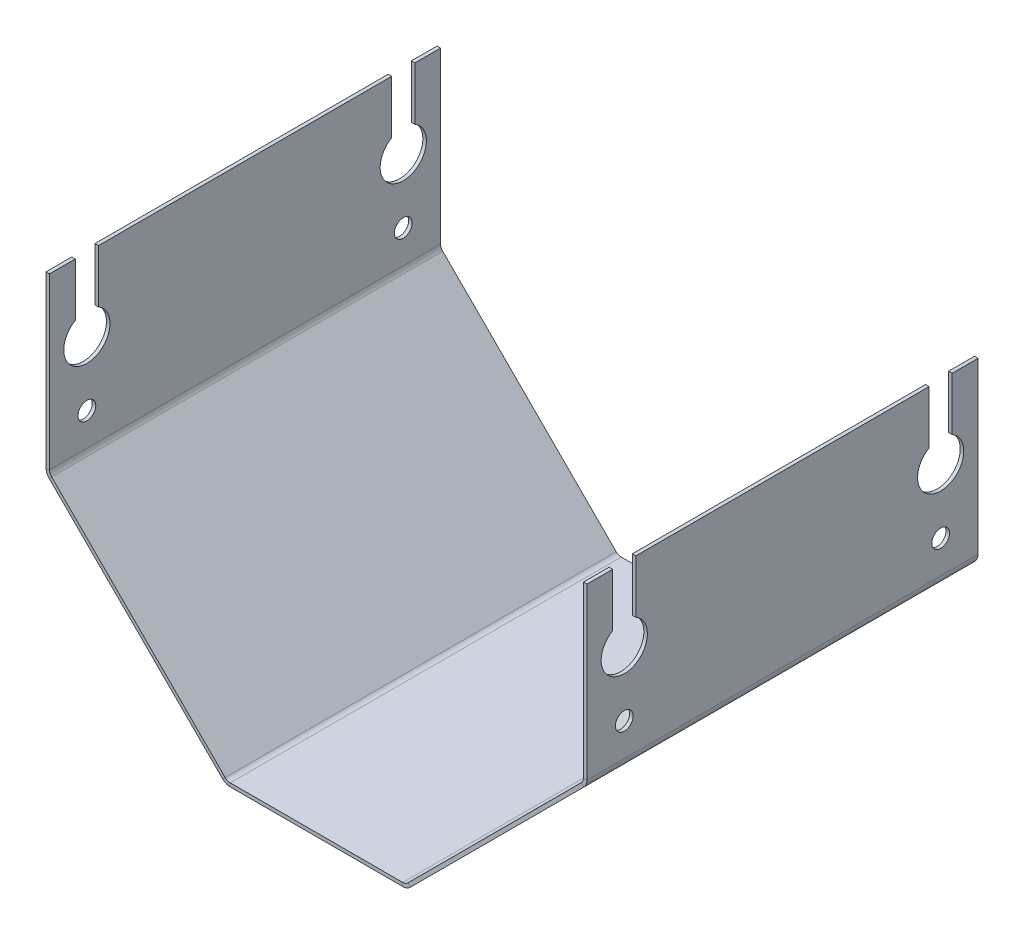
ISO-10303-21;
HEADER;
FILE_DESCRIPTION(('STEP AP214'),'2;1');
FILE_NAME('part.step','',(''),(''),'','','');
FILE_SCHEMA(('AUTOMOTIVE_DESIGN { 1 0 10303 214 1 1 1 1 }'));
ENDSEC;
DATA;
#1=APPLICATION_CONTEXT('core data for automotive mechanical design processes');
#2=APPLICATION_PROTOCOL_DEFINITION('international standard','automotive_design',2000,#1);
#3=PRODUCT_CONTEXT('',#1,'mechanical');
#4=PRODUCT('Part','Part','',(#3));
#5=PRODUCT_RELATED_PRODUCT_CATEGORY('part','',(#4));
#6=PRODUCT_DEFINITION_FORMATION('','',#4);
#7=PRODUCT_DEFINITION_CONTEXT('part definition',#1,'design');
#8=PRODUCT_DEFINITION('design','',#6,#7);
#9=PRODUCT_DEFINITION_SHAPE('','',#8);
#10=(LENGTH_UNIT() NAMED_UNIT(*) SI_UNIT(.MILLI.,.METRE.));
#11=(NAMED_UNIT(*) PLANE_ANGLE_UNIT() SI_UNIT($,.RADIAN.));
#12=(NAMED_UNIT(*) SI_UNIT($,.STERADIAN.) SOLID_ANGLE_UNIT());
#13=UNCERTAINTY_MEASURE_WITH_UNIT(LENGTH_MEASURE(1.E-05),#10,'distance_accuracy_value','');
#14=(GEOMETRIC_REPRESENTATION_CONTEXT(3) GLOBAL_UNCERTAINTY_ASSIGNED_CONTEXT((#13)) GLOBAL_UNIT_ASSIGNED_CONTEXT((#10,
#11,#12)) REPRESENTATION_CONTEXT('',''));
#15=CARTESIAN_POINT('',(0.,0.,0.));
#16=DIRECTION('',(0.,0.,1.));
#17=DIRECTION('',(1.,0.,0.));
#18=AXIS2_PLACEMENT_3D('',#15,#16,#17);
#19=CARTESIAN_POINT('',(68.9155671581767,98.5844328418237,0.));
#20=DIRECTION('',(0.,1.,0.));
#21=DIRECTION('',(0.,0.,1.));
#22=AXIS2_PLACEMENT_3D('',#19,#20,#21);
#23=PLANE('',#22);
#24=DIRECTION('',(-1.,0.,0.));
#25=VECTOR('',#24,1.);
#26=CARTESIAN_POINT('',(221.084432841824,98.5844328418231,-96.25));
#27=LINE('',#26,#25);
#28=CARTESIAN_POINT('',(69.9155671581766,98.5844328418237,-96.25));
#29=VERTEX_POINT('',#28);
#30=CARTESIAN_POINT('',(68.9155671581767,98.5844328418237,-96.25));
#31=VERTEX_POINT('',#30);
#32=EDGE_CURVE('E321',#29,#31,#27,.T.);
#33=ORIENTED_EDGE('',*,*,#32,.T.);
#34=DIRECTION('',(0.,0.,1.));
#35=VECTOR('',#34,1.);
#36=CARTESIAN_POINT('',(68.9155671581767,98.5844328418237,0.));
#37=LINE('',#36,#35);
#38=CARTESIAN_POINT('',(68.9155671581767,98.5844328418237,-13.75));
#39=VERTEX_POINT('',#38);
#40=EDGE_CURVE('E477',#31,#39,#37,.T.);
#41=ORIENTED_EDGE('',*,*,#40,.T.);
#42=DIRECTION('',(-1.,0.,0.));
#43=VECTOR('',#42,1.);
#44=CARTESIAN_POINT('',(221.084432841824,98.5844328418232,-13.75));
#45=LINE('',#44,#43);
#46=CARTESIAN_POINT('',(69.9155671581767,98.5844328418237,-13.75));
#47=VERTEX_POINT('',#46);
#48=EDGE_CURVE('E310',#47,#39,#45,.T.);
#49=ORIENTED_EDGE('',*,*,#48,.F.);
#50=DIRECTION('',(0.,0.,1.));
#51=VECTOR('',#50,1.);
#52=CARTESIAN_POINT('',(69.9155671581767,98.5844328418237,0.));
#53=LINE('',#52,#51);
#54=EDGE_CURVE('E459',#29,#47,#53,.T.);
#55=ORIENTED_EDGE('',*,*,#54,.F.);
#56=EDGE_LOOP('',(#33,#41,#49,#55));
#57=FACE_BOUND('',#56,.T.);
#58=ADVANCED_FACE('F59',(#57),#23,.T.);
#59=DIRECTION('',(-1.,0.,0.));
#60=VECTOR('',#59,1.);
#61=CARTESIAN_POINT('',(221.084432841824,98.5844328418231,-102.75));
#62=LINE('',#61,#60);
#63=CARTESIAN_POINT('',(69.9155671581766,98.5844328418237,-102.75));
#64=VERTEX_POINT('',#63);
#65=CARTESIAN_POINT('',(68.9155671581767,98.5844328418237,-102.75));
#66=VERTEX_POINT('',#65);
#67=EDGE_CURVE('E348',#64,#66,#62,.T.);
#68=ORIENTED_EDGE('',*,*,#67,.F.);
#69=CARTESIAN_POINT('',(69.9155671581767,98.5844328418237,-110.));
#70=VERTEX_POINT('',#69);
#71=EDGE_CURVE('E456',#70,#64,#53,.T.);
#72=ORIENTED_EDGE('',*,*,#71,.F.);
#73=DIRECTION('',(1.,0.,0.));
#74=VECTOR('',#73,1.);
#75=CARTESIAN_POINT('',(68.9155671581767,98.5844328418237,-110.));
#76=LINE('',#75,#74);
#77=CARTESIAN_POINT('',(68.9155671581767,98.5844328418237,-110.));
#78=VERTEX_POINT('',#77);
#79=EDGE_CURVE('E446',#78,#70,#76,.T.);
#80=ORIENTED_EDGE('',*,*,#79,.F.);
#81=EDGE_CURVE('E474',#78,#66,#37,.T.);
#82=ORIENTED_EDGE('',*,*,#81,.T.);
#83=EDGE_LOOP('',(#68,#72,#80,#82));
#84=FACE_BOUND('',#83,.T.);
#85=ADVANCED_FACE('F743',(#84),#23,.T.);
#86=CARTESIAN_POINT('',(221.084432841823,98.5844328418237,0.));
#87=DIRECTION('',(0.,1.,0.));
#88=DIRECTION('',(0.,0.,-1.));
#89=AXIS2_PLACEMENT_3D('',#86,#87,#88);
#90=PLANE('',#89);
#91=CARTESIAN_POINT('',(221.084432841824,98.5844328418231,-96.25));
#92=VERTEX_POINT('',#91);
#93=CARTESIAN_POINT('',(220.084432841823,98.5844328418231,-96.25));
#94=VERTEX_POINT('',#93);
#95=EDGE_CURVE('E324',#92,#94,#27,.T.);
#96=ORIENTED_EDGE('',*,*,#95,.T.);
#97=DIRECTION('',(0.,0.,-1.));
#98=VECTOR('',#97,1.);
#99=CARTESIAN_POINT('',(220.084432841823,98.5844328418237,0.));
#100=LINE('',#99,#98);
#101=CARTESIAN_POINT('',(220.084432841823,98.5844328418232,-13.75));
#102=VERTEX_POINT('',#101);
#103=EDGE_CURVE('E407',#102,#94,#100,.T.);
#104=ORIENTED_EDGE('',*,*,#103,.F.);
#105=CARTESIAN_POINT('',(221.084432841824,98.5844328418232,-13.75));
#106=VERTEX_POINT('',#105);
#107=EDGE_CURVE('E658',#106,#102,#45,.T.);
#108=ORIENTED_EDGE('',*,*,#107,.F.);
#109=DIRECTION('',(0.,0.,-1.));
#110=VECTOR('',#109,1.);
#111=CARTESIAN_POINT('',(221.084432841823,98.5844328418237,0.));
#112=LINE('',#111,#110);
#113=EDGE_CURVE('E425',#106,#92,#112,.T.);
#114=ORIENTED_EDGE('',*,*,#113,.T.);
#115=EDGE_LOOP('',(#96,#104,#108,#114));
#116=FACE_BOUND('',#115,.T.);
#117=ADVANCED_FACE('F657',(#116),#90,.T.);
#118=CARTESIAN_POINT('',(221.084432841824,98.5844328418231,-102.75));
#119=VERTEX_POINT('',#118);
#120=CARTESIAN_POINT('',(220.084432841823,98.5844328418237,-102.75));
#121=VERTEX_POINT('',#120);
#122=EDGE_CURVE('E345',#119,#121,#62,.T.);
#123=ORIENTED_EDGE('',*,*,#122,.F.);
#124=CARTESIAN_POINT('',(221.084432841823,98.5844328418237,-110.));
#125=VERTEX_POINT('',#124);
#126=EDGE_CURVE('E426',#119,#125,#112,.T.);
#127=ORIENTED_EDGE('',*,*,#126,.T.);
#128=DIRECTION('',(-1.,0.,0.));
#129=VECTOR('',#128,1.);
#130=CARTESIAN_POINT('',(221.084432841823,98.5844328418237,-110.));
#131=LINE('',#130,#129);
#132=CARTESIAN_POINT('',(220.084432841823,98.5844328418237,-110.));
#133=VERTEX_POINT('',#132);
#134=EDGE_CURVE('E419',#125,#133,#131,.T.);
#135=ORIENTED_EDGE('',*,*,#134,.T.);
#136=EDGE_CURVE('E408',#121,#133,#100,.T.);
#137=ORIENTED_EDGE('',*,*,#136,.F.);
#138=EDGE_LOOP('',(#123,#127,#135,#137));
#139=FACE_BOUND('',#138,.T.);
#140=ADVANCED_FACE('F651',(#139),#90,.T.);
#141=CARTESIAN_POINT('',(0.,-1.,-110.));
#142=DIRECTION('',(0.,0.,-1.));
#143=DIRECTION('',(-1.,0.,0.));
#144=AXIS2_PLACEMENT_3D('',#141,#142,#143);
#145=PLANE('',#144);
#146=DIRECTION('',(-1.,0.,0.));
#147=VECTOR('',#146,1.);
#148=CARTESIAN_POINT('',(0.,0.,-110.));
#149=LINE('',#148,#147);
#150=CARTESIAN_POINT('',(169.268252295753,0.,-110.));
#151=VERTEX_POINT('',#150);
#152=CARTESIAN_POINT('',(120.731747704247,0.,-110.));
#153=VERTEX_POINT('',#152);
#154=EDGE_CURVE('E576',#151,#153,#149,.T.);
#155=ORIENTED_EDGE('',*,*,#154,.F.);
#156=DIRECTION('',(0.,-1.,0.));
#157=VECTOR('',#156,1.);
#158=CARTESIAN_POINT('',(169.268252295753,-1.,-110.));
#159=LINE('',#158,#157);
#160=CARTESIAN_POINT('',(169.268252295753,-1.,-110.));
#161=VERTEX_POINT('',#160);
#162=EDGE_CURVE('E563',#151,#161,#159,.T.);
#163=ORIENTED_EDGE('',*,*,#162,.T.);
#164=DIRECTION('',(-1.,0.,0.));
#165=VECTOR('',#164,1.);
#166=CARTESIAN_POINT('',(0.,-1.,-110.));
#167=LINE('',#166,#165);
#168=CARTESIAN_POINT('',(120.731747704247,-1.,-110.));
#169=VERTEX_POINT('',#168);
#170=EDGE_CURVE('E551',#161,#169,#167,.T.);
#171=ORIENTED_EDGE('',*,*,#170,.T.);
#172=DIRECTION('',(0.,-1.,0.));
#173=VECTOR('',#172,1.);
#174=CARTESIAN_POINT('',(120.731747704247,-1.,-110.));
#175=LINE('',#174,#173);
#176=EDGE_CURVE('E557',#153,#169,#175,.T.);
#177=ORIENTED_EDGE('',*,*,#176,.F.);
#178=EDGE_LOOP('',(#155,#163,#171,#177));
#179=FACE_BOUND('',#178,.T.);
#180=ADVANCED_FACE('F830',(#179),#145,.T.);
#181=CARTESIAN_POINT('',(0.,-1.,0.));
#182=DIRECTION('',(0.,0.,1.));
#183=DIRECTION('',(1.,0.,0.));
#184=AXIS2_PLACEMENT_3D('',#181,#182,#183);
#185=PLANE('',#184);
#186=DIRECTION('',(1.,0.,0.));
#187=VECTOR('',#186,1.);
#188=CARTESIAN_POINT('',(0.,-1.,0.));
#189=LINE('',#188,#187);
#190=CARTESIAN_POINT('',(120.731747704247,-1.,0.));
#191=VERTEX_POINT('',#190);
#192=CARTESIAN_POINT('',(169.268252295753,-1.,0.));
#193=VERTEX_POINT('',#192);
#194=EDGE_CURVE('E573',#191,#193,#189,.T.);
#195=ORIENTED_EDGE('',*,*,#194,.T.);
#196=DIRECTION('',(0.,1.,0.));
#197=VECTOR('',#196,1.);
#198=CARTESIAN_POINT('',(169.268252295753,-1.,0.));
#199=LINE('',#198,#197);
#200=CARTESIAN_POINT('',(169.268252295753,0.,0.));
#201=VERTEX_POINT('',#200);
#202=EDGE_CURVE('E569',#193,#201,#199,.T.);
#203=ORIENTED_EDGE('',*,*,#202,.T.);
#204=DIRECTION('',(1.,0.,0.));
#205=VECTOR('',#204,1.);
#206=CARTESIAN_POINT('',(0.,0.,0.));
#207=LINE('',#206,#205);
#208=CARTESIAN_POINT('',(120.731747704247,0.,0.));
#209=VERTEX_POINT('',#208);
#210=EDGE_CURVE('E541',#209,#201,#207,.T.);
#211=ORIENTED_EDGE('',*,*,#210,.F.);
#212=DIRECTION('',(0.,1.,0.));
#213=VECTOR('',#212,1.);
#214=CARTESIAN_POINT('',(120.731747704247,-1.,0.));
#215=LINE('',#214,#213);
#216=EDGE_CURVE('E550',#191,#209,#215,.T.);
#217=ORIENTED_EDGE('',*,*,#216,.F.);
#218=EDGE_LOOP('',(#195,#203,#211,#217));
#219=FACE_BOUND('',#218,.T.);
#220=ADVANCED_FACE('F702',(#219),#185,.T.);
#221=CARTESIAN_POINT('',(0.,-1.,0.));
#222=DIRECTION('',(0.,-1.,0.));
#223=DIRECTION('',(0.,0.,-1.));
#224=AXIS2_PLACEMENT_3D('',#221,#222,#223);
#225=PLANE('',#224);
#226=ORIENTED_EDGE('',*,*,#170,.F.);
#227=DIRECTION('',(0.,0.,1.));
#228=VECTOR('',#227,1.);
#229=CARTESIAN_POINT('',(169.268252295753,-1.,0.));
#230=LINE('',#229,#228);
#231=EDGE_CURVE('E560',#161,#193,#230,.T.);
#232=ORIENTED_EDGE('',*,*,#231,.T.);
#233=ORIENTED_EDGE('',*,*,#194,.F.);
#234=DIRECTION('',(0.,0.,1.));
#235=VECTOR('',#234,1.);
#236=CARTESIAN_POINT('',(120.731747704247,-1.,0.));
#237=LINE('',#236,#235);
#238=EDGE_CURVE('E547',#169,#191,#237,.T.);
#239=ORIENTED_EDGE('',*,*,#238,.F.);
#240=EDGE_LOOP('',(#226,#232,#233,#239));
#241=FACE_BOUND('',#240,.T.);
#242=ADVANCED_FACE('F706',(#241),#225,.T.);
#243=CARTESIAN_POINT('',(0.,0.,0.));
#244=DIRECTION('',(0.,-1.,0.));
#245=DIRECTION('',(0.,0.,-1.));
#246=AXIS2_PLACEMENT_3D('',#243,#244,#245);
#247=PLANE('',#246);
#248=DIRECTION('',(0.,0.,1.));
#249=VECTOR('',#248,1.);
#250=CARTESIAN_POINT('',(169.268252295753,0.,0.));
#251=LINE('',#250,#249);
#252=EDGE_CURVE('E566',#151,#201,#251,.T.);
#253=ORIENTED_EDGE('',*,*,#252,.F.);
#254=ORIENTED_EDGE('',*,*,#154,.T.);
#255=DIRECTION('',(0.,0.,1.));
#256=VECTOR('',#255,1.);
#257=CARTESIAN_POINT('',(120.731747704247,0.,0.));
#258=LINE('',#257,#256);
#259=EDGE_CURVE('E554',#153,#209,#258,.T.);
#260=ORIENTED_EDGE('',*,*,#259,.T.);
#261=ORIENTED_EDGE('',*,*,#210,.T.);
#262=EDGE_LOOP('',(#253,#254,#260,#261));
#263=FACE_BOUND('',#262,.T.);
#264=ADVANCED_FACE('F835',(#263),#247,.F.);
#265=CARTESIAN_POINT('',(120.731747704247,2.,-110.));
#266=DIRECTION('',(0.,0.,-1.));
#267=DIRECTION('',(-1.,0.,0.));
#268=AXIS2_PLACEMENT_3D('',#265,#266,#267);
#269=PLANE('',#268);
#270=DIRECTION('',(-0.707106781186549,-0.707106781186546,0.));
#271=VECTOR('',#270,1.);
#272=CARTESIAN_POINT('',(118.610427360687,-0.121320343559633,-110.));
#273=LINE('',#272,#271);
#274=CARTESIAN_POINT('',(119.317534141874,0.585786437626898,-110.));
#275=VERTEX_POINT('',#274);
#276=CARTESIAN_POINT('',(118.610427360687,-0.121320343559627,-110.));
#277=VERTEX_POINT('',#276);
#278=EDGE_CURVE('E520',#275,#277,#273,.T.);
#279=ORIENTED_EDGE('',*,*,#278,.F.);
#280=CARTESIAN_POINT('',(120.731747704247,2.,-110.));
#281=DIRECTION('',(0.,0.,-1.));
#282=DIRECTION('',(-1.,0.,0.));
#283=AXIS2_PLACEMENT_3D('',#280,#281,#282);
#284=CIRCLE('',#283,2.);
#285=EDGE_CURVE('E542',#275,#153,#284,.F.);
#286=ORIENTED_EDGE('',*,*,#285,.T.);
#287=ORIENTED_EDGE('',*,*,#176,.T.);
#288=CARTESIAN_POINT('',(120.731747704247,2.,-110.));
#289=DIRECTION('',(0.,0.,1.));
#290=DIRECTION('',(-1.,0.,0.));
#291=AXIS2_PLACEMENT_3D('',#288,#289,#290);
#292=CIRCLE('',#291,3.);
#293=EDGE_CURVE('E534',#277,#169,#292,.T.);
#294=ORIENTED_EDGE('',*,*,#293,.F.);
#295=EDGE_LOOP('',(#279,#286,#287,#294));
#296=FACE_BOUND('',#295,.T.);
#297=ADVANCED_FACE('F825',(#296),#269,.T.);
#298=CARTESIAN_POINT('',(120.731747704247,2.,0.));
#299=DIRECTION('',(0.,0.,1.));
#300=DIRECTION('',(1.,0.,0.));
#301=AXIS2_PLACEMENT_3D('',#298,#299,#300);
#302=PLANE('',#301);
#303=CARTESIAN_POINT('',(120.731747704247,2.,0.));
#304=DIRECTION('',(0.,0.,-1.));
#305=DIRECTION('',(-1.,0.,0.));
#306=AXIS2_PLACEMENT_3D('',#303,#304,#305);
#307=CIRCLE('',#306,2.);
#308=CARTESIAN_POINT('',(119.317534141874,0.585786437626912,0.));
#309=VERTEX_POINT('',#308);
#310=EDGE_CURVE('E538',#209,#309,#307,.T.);
#311=ORIENTED_EDGE('',*,*,#310,.T.);
#312=DIRECTION('',(0.707106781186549,0.707106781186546,0.));
#313=VECTOR('',#312,1.);
#314=CARTESIAN_POINT('',(118.610427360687,-0.121320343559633,0.));
#315=LINE('',#314,#313);
#316=CARTESIAN_POINT('',(118.610427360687,-0.121320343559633,0.));
#317=VERTEX_POINT('',#316);
#318=EDGE_CURVE('E524',#317,#309,#315,.T.);
#319=ORIENTED_EDGE('',*,*,#318,.F.);
#320=CARTESIAN_POINT('',(120.731747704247,2.,0.));
#321=DIRECTION('',(0.,0.,-1.));
#322=DIRECTION('',(1.,0.,0.));
#323=AXIS2_PLACEMENT_3D('',#320,#321,#322);
#324=CIRCLE('',#323,3.00000000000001);
#325=EDGE_CURVE('E537',#191,#317,#324,.T.);
#326=ORIENTED_EDGE('',*,*,#325,.F.);
#327=ORIENTED_EDGE('',*,*,#216,.T.);
#328=EDGE_LOOP('',(#311,#319,#326,#327));
#329=FACE_BOUND('',#328,.T.);
#330=ADVANCED_FACE('F820',(#329),#302,.T.);
#331=CARTESIAN_POINT('',(120.731747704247,2.,55.0220673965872));
#332=DIRECTION('',(0.,0.,-1.));
#333=DIRECTION('',(-1.,0.,0.));
#334=AXIS2_PLACEMENT_3D('',#331,#332,#333);
#335=CYLINDRICAL_SURFACE('',#334,3.);
#336=ORIENTED_EDGE('',*,*,#238,.T.);
#337=ORIENTED_EDGE('',*,*,#325,.T.);
#338=DIRECTION('',(0.,0.,1.));
#339=VECTOR('',#338,1.);
#340=CARTESIAN_POINT('',(118.610427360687,-0.121320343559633,0.));
#341=LINE('',#340,#339);
#342=EDGE_CURVE('E529',#277,#317,#341,.T.);
#343=ORIENTED_EDGE('',*,*,#342,.F.);
#344=ORIENTED_EDGE('',*,*,#293,.T.);
#345=EDGE_LOOP('',(#336,#337,#343,#344));
#346=FACE_BOUND('',#345,.T.);
#347=ADVANCED_FACE('F822',(#346),#335,.T.);
#348=CARTESIAN_POINT('',(120.731747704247,2.,55.0220673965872));
#349=DIRECTION('',(0.,0.,-1.));
#350=DIRECTION('',(-1.,0.,0.));
#351=AXIS2_PLACEMENT_3D('',#348,#349,#350);
#352=CYLINDRICAL_SURFACE('',#351,2.);
#353=ORIENTED_EDGE('',*,*,#259,.F.);
#354=ORIENTED_EDGE('',*,*,#285,.F.);
#355=DIRECTION('',(0.,0.,1.));
#356=VECTOR('',#355,1.);
#357=CARTESIAN_POINT('',(119.317534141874,0.585786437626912,0.));
#358=LINE('',#357,#356);
#359=EDGE_CURVE('E514',#275,#309,#358,.T.);
#360=ORIENTED_EDGE('',*,*,#359,.T.);
#361=ORIENTED_EDGE('',*,*,#310,.F.);
#362=EDGE_LOOP('',(#353,#354,#360,#361));
#363=FACE_BOUND('',#362,.T.);
#364=ADVANCED_FACE('F833',(#363),#352,.F.);
#365=CARTESIAN_POINT('',(34.6285907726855,83.8605162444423,0.));
#366=DIRECTION('',(-0.707106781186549,-0.707106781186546,0.));
#367=DIRECTION('',(0.,0.,-1.));
#368=AXIS2_PLACEMENT_3D('',#365,#366,#367);
#369=PLANE('',#368);
#370=DIRECTION('',(0.,0.,1.));
#371=VECTOR('',#370,1.);
#372=CARTESIAN_POINT('',(69.7942468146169,48.6948602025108,0.));
#373=LINE('',#372,#371);
#374=CARTESIAN_POINT('',(69.7942468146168,48.6948602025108,-110.));
#375=VERTEX_POINT('',#374);
#376=CARTESIAN_POINT('',(69.7942468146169,48.6948602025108,0.));
#377=VERTEX_POINT('',#376);
#378=EDGE_CURVE('E572',#375,#377,#373,.T.);
#379=ORIENTED_EDGE('',*,*,#378,.F.);
#380=DIRECTION('',(-0.707106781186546,0.707106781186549,0.));
#381=VECTOR('',#380,1.);
#382=CARTESIAN_POINT('',(34.6285907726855,83.8605162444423,-110.));
#383=LINE('',#382,#381);
#384=EDGE_CURVE('E522',#277,#375,#383,.T.);
#385=ORIENTED_EDGE('',*,*,#384,.F.);
#386=ORIENTED_EDGE('',*,*,#342,.T.);
#387=DIRECTION('',(0.707106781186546,-0.707106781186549,0.));
#388=VECTOR('',#387,1.);
#389=CARTESIAN_POINT('',(34.6285907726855,83.8605162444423,0.));
#390=LINE('',#389,#388);
#391=EDGE_CURVE('E528',#377,#317,#390,.T.);
#392=ORIENTED_EDGE('',*,*,#391,.F.);
#393=EDGE_LOOP('',(#379,#385,#386,#392));
#394=FACE_BOUND('',#393,.T.);
#395=ADVANCED_FACE('F813',(#394),#369,.T.);
#396=CARTESIAN_POINT('',(34.6285907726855,83.8605162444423,0.));
#397=DIRECTION('',(0.,0.,1.));
#398=DIRECTION('',(0.707106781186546,-0.707106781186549,0.));
#399=AXIS2_PLACEMENT_3D('',#396,#397,#398);
#400=PLANE('',#399);
#401=DIRECTION('',(0.707106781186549,0.707106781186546,0.));
#402=VECTOR('',#401,1.);
#403=CARTESIAN_POINT('',(69.7942468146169,48.6948602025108,0.));
#404=LINE('',#403,#402);
#405=CARTESIAN_POINT('',(70.5013535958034,49.4019669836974,0.));
#406=VERTEX_POINT('',#405);
#407=EDGE_CURVE('E584',#377,#406,#404,.T.);
#408=ORIENTED_EDGE('',*,*,#407,.F.);
#409=ORIENTED_EDGE('',*,*,#391,.T.);
#410=ORIENTED_EDGE('',*,*,#318,.T.);
#411=DIRECTION('',(0.707106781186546,-0.707106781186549,0.));
#412=VECTOR('',#411,1.);
#413=CARTESIAN_POINT('',(35.335697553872,84.5676230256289,0.));
#414=LINE('',#413,#412);
#415=EDGE_CURVE('E523',#406,#309,#414,.T.);
#416=ORIENTED_EDGE('',*,*,#415,.F.);
#417=EDGE_LOOP('',(#408,#409,#410,#416));
#418=FACE_BOUND('',#417,.T.);
#419=ADVANCED_FACE('F811',(#418),#400,.T.);
#420=CARTESIAN_POINT('',(35.335697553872,84.5676230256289,0.));
#421=DIRECTION('',(-0.707106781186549,-0.707106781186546,0.));
#422=DIRECTION('',(0.,0.,-1.));
#423=AXIS2_PLACEMENT_3D('',#420,#421,#422);
#424=PLANE('',#423);
#425=DIRECTION('',(-0.707106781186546,0.707106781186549,0.));
#426=VECTOR('',#425,1.);
#427=CARTESIAN_POINT('',(35.335697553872,84.5676230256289,-110.));
#428=LINE('',#427,#426);
#429=CARTESIAN_POINT('',(70.5013535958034,49.4019669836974,-110.));
#430=VERTEX_POINT('',#429);
#431=EDGE_CURVE('E527',#275,#430,#428,.T.);
#432=ORIENTED_EDGE('',*,*,#431,.T.);
#433=DIRECTION('',(0.,0.,1.));
#434=VECTOR('',#433,1.);
#435=CARTESIAN_POINT('',(70.5013535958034,49.4019669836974,0.));
#436=LINE('',#435,#434);
#437=EDGE_CURVE('E587',#430,#406,#436,.T.);
#438=ORIENTED_EDGE('',*,*,#437,.T.);
#439=ORIENTED_EDGE('',*,*,#415,.T.);
#440=ORIENTED_EDGE('',*,*,#359,.F.);
#441=EDGE_LOOP('',(#432,#438,#439,#440));
#442=FACE_BOUND('',#441,.T.);
#443=ADVANCED_FACE('F805',(#442),#424,.F.);
#444=CARTESIAN_POINT('',(34.6285907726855,83.8605162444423,-110.));
#445=DIRECTION('',(0.,0.,-1.));
#446=DIRECTION('',(-0.707106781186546,0.707106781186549,0.));
#447=AXIS2_PLACEMENT_3D('',#444,#445,#446);
#448=PLANE('',#447);
#449=DIRECTION('',(-0.707106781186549,-0.707106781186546,0.));
#450=VECTOR('',#449,1.);
#451=CARTESIAN_POINT('',(69.7942468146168,48.6948602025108,-110.));
#452=LINE('',#451,#450);
#453=EDGE_CURVE('E590',#430,#375,#452,.T.);
#454=ORIENTED_EDGE('',*,*,#453,.F.);
#455=ORIENTED_EDGE('',*,*,#431,.F.);
#456=ORIENTED_EDGE('',*,*,#278,.T.);
#457=ORIENTED_EDGE('',*,*,#384,.T.);
#458=EDGE_LOOP('',(#454,#455,#456,#457));
#459=FACE_BOUND('',#458,.T.);
#460=ADVANCED_FACE('F799',(#459),#448,.T.);
#461=CARTESIAN_POINT('',(169.268252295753,2.,-110.));
#462=DIRECTION('',(0.,0.,-1.));
#463=DIRECTION('',(-1.,0.,0.));
#464=AXIS2_PLACEMENT_3D('',#461,#462,#463);
#465=PLANE('',#464);
#466=ORIENTED_EDGE('',*,*,#162,.F.);
#467=CARTESIAN_POINT('',(169.268252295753,2.,-110.));
#468=DIRECTION('',(0.,0.,1.));
#469=DIRECTION('',(1.,0.,0.));
#470=AXIS2_PLACEMENT_3D('',#467,#468,#469);
#471=CIRCLE('',#470,2.);
#472=CARTESIAN_POINT('',(170.682465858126,0.585786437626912,-110.));
#473=VERTEX_POINT('',#472);
#474=EDGE_CURVE('E515',#151,#473,#471,.T.);
#475=ORIENTED_EDGE('',*,*,#474,.T.);
#476=DIRECTION('',(0.707106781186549,-0.707106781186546,0.));
#477=VECTOR('',#476,1.);
#478=CARTESIAN_POINT('',(171.389572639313,-0.121320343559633,-110.));
#479=LINE('',#478,#477);
#480=CARTESIAN_POINT('',(171.389572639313,-0.121320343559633,-110.));
#481=VERTEX_POINT('',#480);
#482=EDGE_CURVE('E498',#473,#481,#479,.T.);
#483=ORIENTED_EDGE('',*,*,#482,.T.);
#484=CARTESIAN_POINT('',(169.268252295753,2.,-110.));
#485=DIRECTION('',(0.,0.,1.));
#486=DIRECTION('',(-1.,0.,0.));
#487=AXIS2_PLACEMENT_3D('',#484,#485,#486);
#488=CIRCLE('',#487,3.);
#489=EDGE_CURVE('E507',#161,#481,#488,.T.);
#490=ORIENTED_EDGE('',*,*,#489,.F.);
#491=EDGE_LOOP('',(#466,#475,#483,#490));
#492=FACE_BOUND('',#491,.T.);
#493=ADVANCED_FACE('F708',(#492),#465,.T.);
#494=CARTESIAN_POINT('',(169.268252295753,2.,0.));
#495=DIRECTION('',(0.,0.,1.));
#496=DIRECTION('',(1.,0.,0.));
#497=AXIS2_PLACEMENT_3D('',#494,#495,#496);
#498=PLANE('',#497);
#499=CARTESIAN_POINT('',(169.268252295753,2.,-1.11022302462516E-13));
#500=DIRECTION('',(0.,0.,1.));
#501=DIRECTION('',(1.,0.,0.));
#502=AXIS2_PLACEMENT_3D('',#499,#500,#501);
#503=CIRCLE('',#502,2.);
#504=CARTESIAN_POINT('',(170.682465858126,0.585786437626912,0.));
#505=VERTEX_POINT('',#504);
#506=EDGE_CURVE('E511',#505,#201,#503,.F.);
#507=ORIENTED_EDGE('',*,*,#506,.T.);
#508=ORIENTED_EDGE('',*,*,#202,.F.);
#509=CARTESIAN_POINT('',(169.268252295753,2.,0.));
#510=DIRECTION('',(0.,0.,-1.));
#511=DIRECTION('',(1.,0.,0.));
#512=AXIS2_PLACEMENT_3D('',#509,#510,#511);
#513=CIRCLE('',#512,3.);
#514=CARTESIAN_POINT('',(171.389572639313,-0.121320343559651,0.));
#515=VERTEX_POINT('',#514);
#516=EDGE_CURVE('E510',#515,#193,#513,.T.);
#517=ORIENTED_EDGE('',*,*,#516,.F.);
#518=DIRECTION('',(-0.707106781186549,0.707106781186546,0.));
#519=VECTOR('',#518,1.);
#520=CARTESIAN_POINT('',(171.389572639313,-0.121320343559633,0.));
#521=LINE('',#520,#519);
#522=EDGE_CURVE('E502',#515,#505,#521,.T.);
#523=ORIENTED_EDGE('',*,*,#522,.T.);
#524=EDGE_LOOP('',(#507,#508,#517,#523));
#525=FACE_BOUND('',#524,.T.);
#526=ADVANCED_FACE('F699',(#525),#498,.T.);
#527=CARTESIAN_POINT('',(169.268252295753,2.,-165.022067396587));
#528=DIRECTION('',(0.,0.,1.));
#529=DIRECTION('',(1.,0.,0.));
#530=AXIS2_PLACEMENT_3D('',#527,#528,#529);
#531=CYLINDRICAL_SURFACE('',#530,3.);
#532=DIRECTION('',(0.,0.,1.));
#533=VECTOR('',#532,1.);
#534=CARTESIAN_POINT('',(171.389572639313,-0.121320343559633,0.));
#535=LINE('',#534,#533);
#536=EDGE_CURVE('E488',#481,#515,#535,.T.);
#537=ORIENTED_EDGE('',*,*,#536,.T.);
#538=ORIENTED_EDGE('',*,*,#516,.T.);
#539=ORIENTED_EDGE('',*,*,#231,.F.);
#540=ORIENTED_EDGE('',*,*,#489,.T.);
#541=EDGE_LOOP('',(#537,#538,#539,#540));
#542=FACE_BOUND('',#541,.T.);
#543=ADVANCED_FACE('F696',(#542),#531,.T.);
#544=CARTESIAN_POINT('',(169.268252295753,2.,-165.022067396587));
#545=DIRECTION('',(0.,0.,1.));
#546=DIRECTION('',(1.,0.,0.));
#547=AXIS2_PLACEMENT_3D('',#544,#545,#546);
#548=CYLINDRICAL_SURFACE('',#547,2.);
#549=DIRECTION('',(0.,0.,1.));
#550=VECTOR('',#549,1.);
#551=CARTESIAN_POINT('',(170.682465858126,0.585786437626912,0.));
#552=LINE('',#551,#550);
#553=EDGE_CURVE('E493',#473,#505,#552,.T.);
#554=ORIENTED_EDGE('',*,*,#553,.F.);
#555=ORIENTED_EDGE('',*,*,#474,.F.);
#556=ORIENTED_EDGE('',*,*,#252,.T.);
#557=ORIENTED_EDGE('',*,*,#506,.F.);
#558=EDGE_LOOP('',(#554,#555,#556,#557));
#559=FACE_BOUND('',#558,.T.);
#560=ADVANCED_FACE('F717',(#559),#548,.F.);
#561=CARTESIAN_POINT('',(50.310442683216,-121.200450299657,0.));
#562=DIRECTION('',(0.707106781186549,-0.707106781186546,0.));
#563=DIRECTION('',(0.,0.,-1.));
#564=AXIS2_PLACEMENT_3D('',#561,#562,#563);
#565=PLANE('',#564);
#566=DIRECTION('',(-0.707106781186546,-0.707106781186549,0.));
#567=VECTOR('',#566,1.);
#568=CARTESIAN_POINT('',(50.310442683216,-121.200450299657,-110.));
#569=LINE('',#568,#567);
#570=CARTESIAN_POINT('',(220.205753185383,48.6948602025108,-110.));
#571=VERTEX_POINT('',#570);
#572=EDGE_CURVE('E501',#571,#481,#569,.T.);
#573=ORIENTED_EDGE('',*,*,#572,.F.);
#574=DIRECTION('',(0.,0.,1.));
#575=VECTOR('',#574,1.);
#576=CARTESIAN_POINT('',(220.205753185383,48.6948602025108,0.));
#577=LINE('',#576,#575);
#578=CARTESIAN_POINT('',(220.205753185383,48.6948602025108,0.));
#579=VERTEX_POINT('',#578);
#580=EDGE_CURVE('E593',#571,#579,#577,.T.);
#581=ORIENTED_EDGE('',*,*,#580,.T.);
#582=DIRECTION('',(0.707106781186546,0.707106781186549,0.));
#583=VECTOR('',#582,1.);
#584=CARTESIAN_POINT('',(50.310442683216,-121.200450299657,0.));
#585=LINE('',#584,#583);
#586=EDGE_CURVE('E518',#515,#579,#585,.T.);
#587=ORIENTED_EDGE('',*,*,#586,.F.);
#588=ORIENTED_EDGE('',*,*,#536,.F.);
#589=EDGE_LOOP('',(#573,#581,#587,#588));
#590=FACE_BOUND('',#589,.T.);
#591=ADVANCED_FACE('F693',(#590),#565,.T.);
#592=CARTESIAN_POINT('',(50.310442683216,-121.200450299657,-110.));
#593=DIRECTION('',(0.,0.,-1.));
#594=DIRECTION('',(-0.707106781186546,-0.707106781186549,0.));
#595=AXIS2_PLACEMENT_3D('',#592,#593,#594);
#596=PLANE('',#595);
#597=DIRECTION('',(-0.707106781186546,-0.707106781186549,0.));
#598=VECTOR('',#597,1.);
#599=CARTESIAN_POINT('',(49.6033359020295,-120.49334351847,-110.));
#600=LINE('',#599,#598);
#601=CARTESIAN_POINT('',(219.498646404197,49.4019669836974,-110.));
#602=VERTEX_POINT('',#601);
#603=EDGE_CURVE('E497',#602,#473,#600,.T.);
#604=ORIENTED_EDGE('',*,*,#603,.F.);
#605=DIRECTION('',(0.707106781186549,-0.707106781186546,0.));
#606=VECTOR('',#605,1.);
#607=CARTESIAN_POINT('',(220.205753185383,48.6948602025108,-110.));
#608=LINE('',#607,#606);
#609=EDGE_CURVE('E600',#602,#571,#608,.T.);
#610=ORIENTED_EDGE('',*,*,#609,.T.);
#611=ORIENTED_EDGE('',*,*,#572,.T.);
#612=ORIENTED_EDGE('',*,*,#482,.F.);
#613=EDGE_LOOP('',(#604,#610,#611,#612));
#614=FACE_BOUND('',#613,.T.);
#615=ADVANCED_FACE('F714',(#614),#596,.T.);
#616=CARTESIAN_POINT('',(49.6033359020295,-120.49334351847,0.));
#617=DIRECTION('',(0.707106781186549,-0.707106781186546,0.));
#618=DIRECTION('',(0.,0.,-1.));
#619=AXIS2_PLACEMENT_3D('',#616,#617,#618);
#620=PLANE('',#619);
#621=DIRECTION('',(0.,0.,1.));
#622=VECTOR('',#621,1.);
#623=CARTESIAN_POINT('',(219.498646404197,49.4019669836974,0.));
#624=LINE('',#623,#622);
#625=CARTESIAN_POINT('',(219.498646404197,49.4019669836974,0.));
#626=VERTEX_POINT('',#625);
#627=EDGE_CURVE('E603',#602,#626,#624,.T.);
#628=ORIENTED_EDGE('',*,*,#627,.F.);
#629=ORIENTED_EDGE('',*,*,#603,.T.);
#630=ORIENTED_EDGE('',*,*,#553,.T.);
#631=DIRECTION('',(0.707106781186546,0.707106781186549,0.));
#632=VECTOR('',#631,1.);
#633=CARTESIAN_POINT('',(49.6033359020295,-120.49334351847,0.));
#634=LINE('',#633,#632);
#635=EDGE_CURVE('E496',#505,#626,#634,.T.);
#636=ORIENTED_EDGE('',*,*,#635,.T.);
#637=EDGE_LOOP('',(#628,#629,#630,#636));
#638=FACE_BOUND('',#637,.T.);
#639=ADVANCED_FACE('F720',(#638),#620,.F.);
#640=CARTESIAN_POINT('',(50.310442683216,-121.200450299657,0.));
#641=DIRECTION('',(0.,0.,1.));
#642=DIRECTION('',(0.707106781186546,0.707106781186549,0.));
#643=AXIS2_PLACEMENT_3D('',#640,#641,#642);
#644=PLANE('',#643);
#645=ORIENTED_EDGE('',*,*,#586,.T.);
#646=DIRECTION('',(-0.707106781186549,0.707106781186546,0.));
#647=VECTOR('',#646,1.);
#648=CARTESIAN_POINT('',(220.205753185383,48.6948602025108,0.));
#649=LINE('',#648,#647);
#650=EDGE_CURVE('E606',#579,#626,#649,.T.);
#651=ORIENTED_EDGE('',*,*,#650,.T.);
#652=ORIENTED_EDGE('',*,*,#635,.F.);
#653=ORIENTED_EDGE('',*,*,#522,.F.);
#654=EDGE_LOOP('',(#645,#651,#652,#653));
#655=FACE_BOUND('',#654,.T.);
#656=ADVANCED_FACE('F61',(#655),#644,.T.);
#657=CARTESIAN_POINT('',(71.9155671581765,50.8161805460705,-110.));
#658=DIRECTION('',(0.,0.,-1.));
#659=DIRECTION('',(-1.,0.,0.));
#660=AXIS2_PLACEMENT_3D('',#657,#658,#659);
#661=PLANE('',#660);
#662=DIRECTION('',(-1.,0.,0.));
#663=VECTOR('',#662,1.);
#664=CARTESIAN_POINT('',(68.9155671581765,50.8161805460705,-110.));
#665=LINE('',#664,#663);
#666=CARTESIAN_POINT('',(69.9155671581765,50.8161805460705,-110.));
#667=VERTEX_POINT('',#666);
#668=CARTESIAN_POINT('',(68.9155671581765,50.8161805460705,-110.));
#669=VERTEX_POINT('',#668);
#670=EDGE_CURVE('E452',#667,#669,#665,.T.);
#671=ORIENTED_EDGE('',*,*,#670,.F.);
#672=CARTESIAN_POINT('',(71.9155671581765,50.8161805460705,-110.));
#673=DIRECTION('',(0.,0.,-1.));
#674=DIRECTION('',(-1.,0.,0.));
#675=AXIS2_PLACEMENT_3D('',#672,#673,#674);
#676=CIRCLE('',#675,2.);
#677=EDGE_CURVE('E449',#667,#430,#676,.F.);
#678=ORIENTED_EDGE('',*,*,#677,.T.);
#679=ORIENTED_EDGE('',*,*,#453,.T.);
#680=CARTESIAN_POINT('',(71.9155671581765,50.8161805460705,-110.));
#681=DIRECTION('',(0.,0.,1.));
#682=DIRECTION('',(-1.,0.,0.));
#683=AXIS2_PLACEMENT_3D('',#680,#681,#682);
#684=CIRCLE('',#683,3.);
#685=EDGE_CURVE('E481',#669,#375,#684,.T.);
#686=ORIENTED_EDGE('',*,*,#685,.F.);
#687=EDGE_LOOP('',(#671,#678,#679,#686));
#688=FACE_BOUND('',#687,.T.);
#689=ADVANCED_FACE('F794',(#688),#661,.T.);
#690=CARTESIAN_POINT('',(71.9155671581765,50.8161805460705,0.));
#691=DIRECTION('',(0.,0.,1.));
#692=DIRECTION('',(1.,0.,0.));
#693=AXIS2_PLACEMENT_3D('',#690,#691,#692);
#694=PLANE('',#693);
#695=CARTESIAN_POINT('',(71.9155671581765,50.8161805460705,0.));
#696=DIRECTION('',(0.,0.,-1.));
#697=DIRECTION('',(-1.,0.,0.));
#698=AXIS2_PLACEMENT_3D('',#695,#696,#697);
#699=CIRCLE('',#698,2.);
#700=CARTESIAN_POINT('',(69.9155671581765,50.8161805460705,0.));
#701=VERTEX_POINT('',#700);
#702=EDGE_CURVE('E485',#406,#701,#699,.T.);
#703=ORIENTED_EDGE('',*,*,#702,.T.);
#704=DIRECTION('',(1.,0.,0.));
#705=VECTOR('',#704,1.);
#706=CARTESIAN_POINT('',(68.9155671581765,50.8161805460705,0.));
#707=LINE('',#706,#705);
#708=CARTESIAN_POINT('',(68.9155671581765,50.8161805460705,0.));
#709=VERTEX_POINT('',#708);
#710=EDGE_CURVE('E463',#709,#701,#707,.T.);
#711=ORIENTED_EDGE('',*,*,#710,.F.);
#712=CARTESIAN_POINT('',(71.9155671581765,50.8161805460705,0.));
#713=DIRECTION('',(0.,0.,-1.));
#714=DIRECTION('',(1.,0.,0.));
#715=AXIS2_PLACEMENT_3D('',#712,#713,#714);
#716=CIRCLE('',#715,3.00000000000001);
#717=EDGE_CURVE('E484',#377,#709,#716,.T.);
#718=ORIENTED_EDGE('',*,*,#717,.F.);
#719=ORIENTED_EDGE('',*,*,#407,.T.);
#720=EDGE_LOOP('',(#703,#711,#718,#719));
#721=FACE_BOUND('',#720,.T.);
#722=ADVANCED_FACE('F808',(#721),#694,.T.);
#723=CARTESIAN_POINT('',(71.9155671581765,50.8161805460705,55.0399123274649));
#724=DIRECTION('',(0.,0.,-1.));
#725=DIRECTION('',(-1.,0.,0.));
#726=AXIS2_PLACEMENT_3D('',#723,#724,#725);
#727=CYLINDRICAL_SURFACE('',#726,3.);
#728=ORIENTED_EDGE('',*,*,#378,.T.);
#729=ORIENTED_EDGE('',*,*,#717,.T.);
#730=DIRECTION('',(0.,0.,1.));
#731=VECTOR('',#730,1.);
#732=CARTESIAN_POINT('',(68.9155671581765,50.8161805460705,0.));
#733=LINE('',#732,#731);
#734=EDGE_CURVE('E469',#669,#709,#733,.T.);
#735=ORIENTED_EDGE('',*,*,#734,.F.);
#736=ORIENTED_EDGE('',*,*,#685,.T.);
#737=EDGE_LOOP('',(#728,#729,#735,#736));
#738=FACE_BOUND('',#737,.T.);
#739=ADVANCED_FACE('F763',(#738),#727,.T.);
#740=CARTESIAN_POINT('',(71.9155671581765,50.8161805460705,55.0399123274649));
#741=DIRECTION('',(0.,0.,-1.));
#742=DIRECTION('',(-1.,0.,0.));
#743=AXIS2_PLACEMENT_3D('',#740,#741,#742);
#744=CYLINDRICAL_SURFACE('',#743,2.);
#745=ORIENTED_EDGE('',*,*,#437,.F.);
#746=ORIENTED_EDGE('',*,*,#677,.F.);
#747=DIRECTION('',(0.,0.,1.));
#748=VECTOR('',#747,1.);
#749=CARTESIAN_POINT('',(69.9155671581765,50.8161805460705,0.));
#750=LINE('',#749,#748);
#751=EDGE_CURVE('E442',#667,#701,#750,.T.);
#752=ORIENTED_EDGE('',*,*,#751,.T.);
#753=ORIENTED_EDGE('',*,*,#702,.F.);
#754=EDGE_LOOP('',(#745,#746,#752,#753));
#755=FACE_BOUND('',#754,.T.);
#756=ADVANCED_FACE('F754',(#755),#744,.F.);
#757=DIRECTION('',(-1.,0.,0.));
#758=VECTOR('',#757,1.);
#759=CARTESIAN_POINT('',(221.084432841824,98.5844328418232,-7.25000000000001));
#760=LINE('',#759,#758);
#761=CARTESIAN_POINT('',(69.9155671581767,98.5844328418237,-7.25000000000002));
#762=VERTEX_POINT('',#761);
#763=CARTESIAN_POINT('',(68.9155671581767,98.5844328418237,-7.25000000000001));
#764=VERTEX_POINT('',#763);
#765=EDGE_CURVE('E83',#762,#764,#760,.T.);
#766=ORIENTED_EDGE('',*,*,#765,.T.);
#767=CARTESIAN_POINT('',(68.9155671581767,98.5844328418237,0.));
#768=VERTEX_POINT('',#767);
#769=EDGE_CURVE('E478',#764,#768,#37,.T.);
#770=ORIENTED_EDGE('',*,*,#769,.T.);
#771=DIRECTION('',(1.,0.,0.));
#772=VECTOR('',#771,1.);
#773=CARTESIAN_POINT('',(68.9155671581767,98.5844328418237,0.));
#774=LINE('',#773,#772);
#775=CARTESIAN_POINT('',(69.9155671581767,98.5844328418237,0.));
#776=VERTEX_POINT('',#775);
#777=EDGE_CURVE('E471',#768,#776,#774,.T.);
#778=ORIENTED_EDGE('',*,*,#777,.T.);
#779=EDGE_CURVE('E460',#762,#776,#53,.T.);
#780=ORIENTED_EDGE('',*,*,#779,.F.);
#781=EDGE_LOOP('',(#766,#770,#778,#780));
#782=FACE_BOUND('',#781,.T.);
#783=ADVANCED_FACE('F746',(#782),#23,.T.);
#784=CARTESIAN_POINT('',(68.9155671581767,98.5844328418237,0.));
#785=DIRECTION('',(-1.,0.,0.));
#786=DIRECTION('',(0.,0.,-1.));
#787=AXIS2_PLACEMENT_3D('',#784,#785,#786);
#788=PLANE('',#787);
#789=CARTESIAN_POINT('',(68.9155671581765,60.0044328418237,-10.5));
#790=DIRECTION('',(-1.,0.,0.));
#791=DIRECTION('',(0.,-1.,0.));
#792=AXIS2_PLACEMENT_3D('',#789,#790,#791);
#793=CIRCLE('',#792,2.5);
#794=CARTESIAN_POINT('',(68.9155671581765,57.5044328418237,-10.5));
#795=VERTEX_POINT('',#794);
#796=EDGE_CURVE('E337',#795,#795,#793,.T.);
#797=ORIENTED_EDGE('',*,*,#796,.F.);
#798=EDGE_LOOP('',(#797));
#799=FACE_BOUND('',#798,.T.);
#800=DIRECTION('',(0.,1.,0.));
#801=VECTOR('',#800,1.);
#802=CARTESIAN_POINT('',(68.9155671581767,98.5844328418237,-96.25));
#803=LINE('',#802,#801);
#804=CARTESIAN_POINT('',(68.9155671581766,83.6335979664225,-96.25));
#805=VERTEX_POINT('',#804);
#806=EDGE_CURVE('E357',#805,#31,#803,.T.);
#807=ORIENTED_EDGE('',*,*,#806,.F.);
#808=CARTESIAN_POINT('',(68.9155671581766,78.0044328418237,-99.5));
#809=DIRECTION('',(-1.,0.,0.));
#810=DIRECTION('',(0.,-1.,0.));
#811=AXIS2_PLACEMENT_3D('',#808,#809,#810);
#812=CIRCLE('',#811,6.5);
#813=CARTESIAN_POINT('',(68.9155671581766,83.6335979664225,-102.75));
#814=VERTEX_POINT('',#813);
#815=EDGE_CURVE('E359',#814,#805,#812,.T.);
#816=ORIENTED_EDGE('',*,*,#815,.F.);
#817=DIRECTION('',(0.,-1.,0.));
#818=VECTOR('',#817,1.);
#819=CARTESIAN_POINT('',(68.9155671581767,98.5844328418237,-102.75));
#820=LINE('',#819,#818);
#821=EDGE_CURVE('E344',#66,#814,#820,.T.);
#822=ORIENTED_EDGE('',*,*,#821,.F.);
#823=ORIENTED_EDGE('',*,*,#81,.F.);
#824=DIRECTION('',(0.,1.,0.));
#825=VECTOR('',#824,1.);
#826=CARTESIAN_POINT('',(68.9155671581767,98.5844328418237,-110.));
#827=LINE('',#826,#825);
#828=EDGE_CURVE('E450',#669,#78,#827,.T.);
#829=ORIENTED_EDGE('',*,*,#828,.F.);
#830=ORIENTED_EDGE('',*,*,#734,.T.);
#831=DIRECTION('',(0.,-1.,0.));
#832=VECTOR('',#831,1.);
#833=CARTESIAN_POINT('',(68.9155671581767,98.5844328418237,0.));
#834=LINE('',#833,#832);
#835=EDGE_CURVE('E466',#768,#709,#834,.T.);
#836=ORIENTED_EDGE('',*,*,#835,.F.);
#837=ORIENTED_EDGE('',*,*,#769,.F.);
#838=DIRECTION('',(0.,1.,0.));
#839=VECTOR('',#838,1.);
#840=CARTESIAN_POINT('',(68.9155671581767,98.5844328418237,-7.25000000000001));
#841=LINE('',#840,#839);
#842=CARTESIAN_POINT('',(68.9155671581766,83.6335979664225,-7.25000000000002));
#843=VERTEX_POINT('',#842);
#844=EDGE_CURVE('E314',#843,#764,#841,.T.);
#845=ORIENTED_EDGE('',*,*,#844,.F.);
#846=CARTESIAN_POINT('',(68.9155671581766,78.0044328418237,-10.5));
#847=DIRECTION('',(-1.,0.,0.));
#848=DIRECTION('',(0.,-1.,0.));
#849=AXIS2_PLACEMENT_3D('',#846,#847,#848);
#850=CIRCLE('',#849,6.5);
#851=CARTESIAN_POINT('',(68.9155671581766,83.6335979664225,-13.75));
#852=VERTEX_POINT('',#851);
#853=EDGE_CURVE('E298',#852,#843,#850,.T.);
#854=ORIENTED_EDGE('',*,*,#853,.F.);
#855=DIRECTION('',(0.,-1.,0.));
#856=VECTOR('',#855,1.);
#857=CARTESIAN_POINT('',(68.9155671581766,83.6335979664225,-13.75));
#858=LINE('',#857,#856);
#859=EDGE_CURVE('E307',#39,#852,#858,.T.);
#860=ORIENTED_EDGE('',*,*,#859,.F.);
#861=ORIENTED_EDGE('',*,*,#40,.F.);
#862=EDGE_LOOP('',(#807,#816,#822,#823,#829,#830,#836,#837,#845,#854,#860,#861));
#863=FACE_BOUND('',#862,.T.);
#864=CARTESIAN_POINT('',(68.9155671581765,60.0044328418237,-99.5));
#865=DIRECTION('',(-1.,0.,0.));
#866=DIRECTION('',(0.,-1.,0.));
#867=AXIS2_PLACEMENT_3D('',#864,#865,#866);
#868=CIRCLE('',#867,2.50000000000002);
#869=CARTESIAN_POINT('',(68.9155671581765,57.5044328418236,-99.5));
#870=VERTEX_POINT('',#869);
#871=EDGE_CURVE('E340',#870,#870,#868,.T.);
#872=ORIENTED_EDGE('',*,*,#871,.F.);
#873=EDGE_LOOP('',(#872));
#874=FACE_BOUND('',#873,.T.);
#875=ADVANCED_FACE('F318',(#799,#863,#874),#788,.T.);
#876=CARTESIAN_POINT('',(68.9155671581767,98.5844328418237,0.));
#877=DIRECTION('',(0.,0.,1.));
#878=DIRECTION('',(0.,-1.,0.));
#879=AXIS2_PLACEMENT_3D('',#876,#877,#878);
#880=PLANE('',#879);
#881=ORIENTED_EDGE('',*,*,#835,.T.);
#882=ORIENTED_EDGE('',*,*,#710,.T.);
#883=DIRECTION('',(0.,-1.,0.));
#884=VECTOR('',#883,1.);
#885=CARTESIAN_POINT('',(69.9155671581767,98.5844328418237,0.));
#886=LINE('',#885,#884);
#887=EDGE_CURVE('E454',#776,#701,#886,.T.);
#888=ORIENTED_EDGE('',*,*,#887,.F.);
#889=ORIENTED_EDGE('',*,*,#777,.F.);
#890=EDGE_LOOP('',(#881,#882,#888,#889));
#891=FACE_BOUND('',#890,.T.);
#892=ADVANCED_FACE('F760',(#891),#880,.T.);
#893=CARTESIAN_POINT('',(69.9155671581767,98.5844328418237,0.));
#894=DIRECTION('',(-1.,0.,0.));
#895=DIRECTION('',(0.,0.,-1.));
#896=AXIS2_PLACEMENT_3D('',#893,#894,#895);
#897=PLANE('',#896);
#898=CARTESIAN_POINT('',(69.9155671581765,60.0044328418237,-10.5));
#899=DIRECTION('',(-1.,0.,0.));
#900=DIRECTION('',(0.,-1.,0.));
#901=AXIS2_PLACEMENT_3D('',#898,#899,#900);
#902=CIRCLE('',#901,2.5);
#903=CARTESIAN_POINT('',(69.9155671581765,57.5044328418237,-10.5));
#904=VERTEX_POINT('',#903);
#905=EDGE_CURVE('E394',#904,#904,#902,.T.);
#906=ORIENTED_EDGE('',*,*,#905,.T.);
#907=EDGE_LOOP('',(#906));
#908=FACE_BOUND('',#907,.T.);
#909=CARTESIAN_POINT('',(69.9155671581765,60.0044328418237,-99.5));
#910=DIRECTION('',(-1.,0.,0.));
#911=DIRECTION('',(0.,-1.,0.));
#912=AXIS2_PLACEMENT_3D('',#909,#910,#911);
#913=CIRCLE('',#912,2.50000000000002);
#914=CARTESIAN_POINT('',(69.9155671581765,57.5044328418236,-99.5));
#915=VERTEX_POINT('',#914);
#916=EDGE_CURVE('E377',#915,#915,#913,.T.);
#917=ORIENTED_EDGE('',*,*,#916,.T.);
#918=EDGE_LOOP('',(#917));
#919=FACE_BOUND('',#918,.T.);
#920=CARTESIAN_POINT('',(69.9155671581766,78.0044328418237,-99.5));
#921=DIRECTION('',(-1.,0.,0.));
#922=DIRECTION('',(0.,-1.,0.));
#923=AXIS2_PLACEMENT_3D('',#920,#921,#922);
#924=CIRCLE('',#923,6.5);
#925=CARTESIAN_POINT('',(69.9155671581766,83.633597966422,-102.75));
#926=VERTEX_POINT('',#925);
#927=CARTESIAN_POINT('',(69.9155671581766,83.6335979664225,-96.25));
#928=VERTEX_POINT('',#927);
#929=EDGE_CURVE('E388',#926,#928,#924,.T.);
#930=ORIENTED_EDGE('',*,*,#929,.T.);
#931=DIRECTION('',(0.,1.,0.));
#932=VECTOR('',#931,1.);
#933=CARTESIAN_POINT('',(69.9155671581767,98.5844328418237,-96.25));
#934=LINE('',#933,#932);
#935=EDGE_CURVE('E391',#928,#29,#934,.T.);
#936=ORIENTED_EDGE('',*,*,#935,.T.);
#937=ORIENTED_EDGE('',*,*,#54,.T.);
#938=DIRECTION('',(0.,-1.,0.));
#939=VECTOR('',#938,1.);
#940=CARTESIAN_POINT('',(69.9155671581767,98.5844328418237,-13.75));
#941=LINE('',#940,#939);
#942=CARTESIAN_POINT('',(69.9155671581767,83.6335979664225,-13.75));
#943=VERTEX_POINT('',#942);
#944=EDGE_CURVE('E382',#47,#943,#941,.T.);
#945=ORIENTED_EDGE('',*,*,#944,.T.);
#946=CARTESIAN_POINT('',(69.9155671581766,78.0044328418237,-10.5));
#947=DIRECTION('',(-1.,0.,0.));
#948=DIRECTION('',(0.,-1.,0.));
#949=AXIS2_PLACEMENT_3D('',#946,#947,#948);
#950=CIRCLE('',#949,6.5);
#951=CARTESIAN_POINT('',(69.9155671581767,83.6335979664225,-7.25000000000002));
#952=VERTEX_POINT('',#951);
#953=EDGE_CURVE('E301',#943,#952,#950,.T.);
#954=ORIENTED_EDGE('',*,*,#953,.T.);
#955=DIRECTION('',(0.,1.,0.));
#956=VECTOR('',#955,1.);
#957=CARTESIAN_POINT('',(69.9155671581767,98.5844328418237,-7.25000000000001));
#958=LINE('',#957,#956);
#959=EDGE_CURVE('E380',#952,#762,#958,.T.);
#960=ORIENTED_EDGE('',*,*,#959,.T.);
#961=ORIENTED_EDGE('',*,*,#779,.T.);
#962=ORIENTED_EDGE('',*,*,#887,.T.);
#963=ORIENTED_EDGE('',*,*,#751,.F.);
#964=DIRECTION('',(0.,1.,0.));
#965=VECTOR('',#964,1.);
#966=CARTESIAN_POINT('',(69.9155671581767,98.5844328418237,-110.));
#967=LINE('',#966,#965);
#968=EDGE_CURVE('E461',#667,#70,#967,.T.);
#969=ORIENTED_EDGE('',*,*,#968,.T.);
#970=ORIENTED_EDGE('',*,*,#71,.T.);
#971=DIRECTION('',(0.,-1.,0.));
#972=VECTOR('',#971,1.);
#973=CARTESIAN_POINT('',(69.9155671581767,98.5844328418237,-102.75));
#974=LINE('',#973,#972);
#975=EDGE_CURVE('E385',#64,#926,#974,.T.);
#976=ORIENTED_EDGE('',*,*,#975,.T.);
#977=EDGE_LOOP('',(#930,#936,#937,#945,#954,#960,#961,#962,#963,#969,#970,#976));
#978=FACE_BOUND('',#977,.T.);
#979=ADVANCED_FACE('F974',(#908,#919,#978),#897,.F.);
#980=CARTESIAN_POINT('',(68.9155671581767,98.5844328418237,-110.));
#981=DIRECTION('',(0.,0.,-1.));
#982=DIRECTION('',(0.,1.,0.));
#983=AXIS2_PLACEMENT_3D('',#980,#981,#982);
#984=PLANE('',#983);
#985=ORIENTED_EDGE('',*,*,#968,.F.);
#986=ORIENTED_EDGE('',*,*,#670,.T.);
#987=ORIENTED_EDGE('',*,*,#828,.T.);
#988=ORIENTED_EDGE('',*,*,#79,.T.);
#989=EDGE_LOOP('',(#985,#986,#987,#988));
#990=FACE_BOUND('',#989,.T.);
#991=ADVANCED_FACE('F786',(#990),#984,.T.);
#992=CARTESIAN_POINT('',(218.084432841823,50.8161805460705,-110.));
#993=DIRECTION('',(0.,0.,-1.));
#994=DIRECTION('',(-1.,0.,0.));
#995=AXIS2_PLACEMENT_3D('',#992,#993,#994);
#996=PLANE('',#995);
#997=ORIENTED_EDGE('',*,*,#609,.F.);
#998=CARTESIAN_POINT('',(218.084432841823,50.8161805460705,-110.));
#999=DIRECTION('',(0.,0.,1.));
#1000=DIRECTION('',(1.,0.,0.));
#1001=AXIS2_PLACEMENT_3D('',#998,#999,#1000);
#1002=CIRCLE('',#1001,2.);
#1003=CARTESIAN_POINT('',(220.084432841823,50.8161805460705,-110.));
#1004=VERTEX_POINT('',#1003);
#1005=EDGE_CURVE('E401',#602,#1004,#1002,.T.);
#1006=ORIENTED_EDGE('',*,*,#1005,.T.);
#1007=DIRECTION('',(1.,0.,0.));
#1008=VECTOR('',#1007,1.);
#1009=CARTESIAN_POINT('',(221.084432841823,50.8161805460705,-110.));
#1010=LINE('',#1009,#1008);
#1011=CARTESIAN_POINT('',(221.084432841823,50.8161805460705,-110.));
#1012=VERTEX_POINT('',#1011);
#1013=EDGE_CURVE('E427',#1004,#1012,#1010,.T.);
#1014=ORIENTED_EDGE('',*,*,#1013,.T.);
#1015=CARTESIAN_POINT('',(218.084432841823,50.8161805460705,-110.));
#1016=DIRECTION('',(0.,0.,1.));
#1017=DIRECTION('',(-1.,0.,0.));
#1018=AXIS2_PLACEMENT_3D('',#1015,#1016,#1017);
#1019=CIRCLE('',#1018,3.);
#1020=EDGE_CURVE('E435',#571,#1012,#1019,.T.);
#1021=ORIENTED_EDGE('',*,*,#1020,.F.);
#1022=EDGE_LOOP('',(#997,#1006,#1014,#1021));
#1023=FACE_BOUND('',#1022,.T.);
#1024=ADVANCED_FACE('F726',(#1023),#996,.T.);
#1025=CARTESIAN_POINT('',(218.084432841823,50.8161805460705,0.));
#1026=DIRECTION('',(0.,0.,1.));
#1027=DIRECTION('',(1.,0.,0.));
#1028=AXIS2_PLACEMENT_3D('',#1025,#1026,#1027);
#1029=PLANE('',#1028);
#1030=CARTESIAN_POINT('',(218.084432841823,50.8161805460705,0.));
#1031=DIRECTION('',(0.,0.,1.));
#1032=DIRECTION('',(1.,0.,0.));
#1033=AXIS2_PLACEMENT_3D('',#1030,#1031,#1032);
#1034=CIRCLE('',#1033,2.);
#1035=CARTESIAN_POINT('',(220.084432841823,50.8161805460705,0.));
#1036=VERTEX_POINT('',#1035);
#1037=EDGE_CURVE('E439',#1036,#626,#1034,.F.);
#1038=ORIENTED_EDGE('',*,*,#1037,.T.);
#1039=ORIENTED_EDGE('',*,*,#650,.F.);
#1040=CARTESIAN_POINT('',(218.084432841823,50.8161805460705,0.));
#1041=DIRECTION('',(0.,0.,-1.));
#1042=DIRECTION('',(1.,0.,0.));
#1043=AXIS2_PLACEMENT_3D('',#1040,#1041,#1042);
#1044=CIRCLE('',#1043,3.);
#1045=CARTESIAN_POINT('',(221.084432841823,50.8161805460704,0.));
#1046=VERTEX_POINT('',#1045);
#1047=EDGE_CURVE('E438',#1046,#579,#1044,.T.);
#1048=ORIENTED_EDGE('',*,*,#1047,.F.);
#1049=DIRECTION('',(-1.,0.,0.));
#1050=VECTOR('',#1049,1.);
#1051=CARTESIAN_POINT('',(221.084432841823,50.8161805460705,0.));
#1052=LINE('',#1051,#1050);
#1053=EDGE_CURVE('E430',#1046,#1036,#1052,.T.);
#1054=ORIENTED_EDGE('',*,*,#1053,.T.);
#1055=EDGE_LOOP('',(#1038,#1039,#1048,#1054));
#1056=FACE_BOUND('',#1055,.T.);
#1057=ADVANCED_FACE('F686',(#1056),#1029,.T.);
#1058=CARTESIAN_POINT('',(218.084432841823,50.8161805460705,-165.039912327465));
#1059=DIRECTION('',(0.,0.,1.));
#1060=DIRECTION('',(1.,0.,0.));
#1061=AXIS2_PLACEMENT_3D('',#1058,#1059,#1060);
#1062=CYLINDRICAL_SURFACE('',#1061,3.);
#1063=DIRECTION('',(0.,0.,1.));
#1064=VECTOR('',#1063,1.);
#1065=CARTESIAN_POINT('',(221.084432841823,50.8161805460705,0.));
#1066=LINE('',#1065,#1064);
#1067=EDGE_CURVE('E397',#1012,#1046,#1066,.T.);
#1068=ORIENTED_EDGE('',*,*,#1067,.T.);
#1069=ORIENTED_EDGE('',*,*,#1047,.T.);
#1070=ORIENTED_EDGE('',*,*,#580,.F.);
#1071=ORIENTED_EDGE('',*,*,#1020,.T.);
#1072=EDGE_LOOP('',(#1068,#1069,#1070,#1071));
#1073=FACE_BOUND('',#1072,.T.);
#1074=ADVANCED_FACE('F683',(#1073),#1062,.T.);
#1075=CARTESIAN_POINT('',(218.084432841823,50.8161805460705,-165.039912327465));
#1076=DIRECTION('',(0.,0.,1.));
#1077=DIRECTION('',(1.,0.,0.));
#1078=AXIS2_PLACEMENT_3D('',#1075,#1076,#1077);
#1079=CYLINDRICAL_SURFACE('',#1078,2.);
#1080=DIRECTION('',(0.,0.,1.));
#1081=VECTOR('',#1080,1.);
#1082=CARTESIAN_POINT('',(220.084432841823,50.8161805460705,0.));
#1083=LINE('',#1082,#1081);
#1084=EDGE_CURVE('E411',#1004,#1036,#1083,.T.);
#1085=ORIENTED_EDGE('',*,*,#1084,.F.);
#1086=ORIENTED_EDGE('',*,*,#1005,.F.);
#1087=ORIENTED_EDGE('',*,*,#627,.T.);
#1088=ORIENTED_EDGE('',*,*,#1037,.F.);
#1089=EDGE_LOOP('',(#1085,#1086,#1087,#1088));
#1090=FACE_BOUND('',#1089,.T.);
#1091=ADVANCED_FACE('F724',(#1090),#1079,.F.);
#1092=CARTESIAN_POINT('',(221.084432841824,98.5844328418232,-7.25000000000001));
#1093=VERTEX_POINT('',#1092);
#1094=CARTESIAN_POINT('',(220.084432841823,98.5844328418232,-7.25000000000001));
#1095=VERTEX_POINT('',#1094);
#1096=EDGE_CURVE('E672',#1093,#1095,#760,.T.);
#1097=ORIENTED_EDGE('',*,*,#1096,.T.);
#1098=CARTESIAN_POINT('',(220.084432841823,98.5844328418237,0.));
#1099=VERTEX_POINT('',#1098);
#1100=EDGE_CURVE('E404',#1099,#1095,#100,.T.);
#1101=ORIENTED_EDGE('',*,*,#1100,.F.);
#1102=DIRECTION('',(-1.,0.,0.));
#1103=VECTOR('',#1102,1.);
#1104=CARTESIAN_POINT('',(221.084432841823,98.5844328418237,0.));
#1105=LINE('',#1104,#1103);
#1106=CARTESIAN_POINT('',(221.084432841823,98.5844328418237,0.));
#1107=VERTEX_POINT('',#1106);
#1108=EDGE_CURVE('E398',#1107,#1099,#1105,.T.);
#1109=ORIENTED_EDGE('',*,*,#1108,.F.);
#1110=EDGE_CURVE('E422',#1107,#1093,#112,.T.);
#1111=ORIENTED_EDGE('',*,*,#1110,.T.);
#1112=EDGE_LOOP('',(#1097,#1101,#1109,#1111));
#1113=FACE_BOUND('',#1112,.T.);
#1114=ADVANCED_FACE('F677',(#1113),#90,.T.);
#1115=CARTESIAN_POINT('',(221.084432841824,-191.415567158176,0.));
#1116=DIRECTION('',(1.,0.,0.));
#1117=DIRECTION('',(0.,0.,-1.));
#1118=AXIS2_PLACEMENT_3D('',#1115,#1116,#1117);
#1119=PLANE('',#1118);
#1120=CARTESIAN_POINT('',(221.084432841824,60.0044328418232,-10.5));
#1121=DIRECTION('',(-1.,0.,0.));
#1122=DIRECTION('',(0.,-1.,0.));
#1123=AXIS2_PLACEMENT_3D('',#1120,#1121,#1122);
#1124=CIRCLE('',#1123,2.5);
#1125=CARTESIAN_POINT('',(221.084432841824,57.5044328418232,-10.5));
#1126=VERTEX_POINT('',#1125);
#1127=EDGE_CURVE('E341',#1126,#1126,#1124,.T.);
#1128=ORIENTED_EDGE('',*,*,#1127,.T.);
#1129=EDGE_LOOP('',(#1128));
#1130=FACE_BOUND('',#1129,.T.);
#1131=DIRECTION('',(0.,1.,0.));
#1132=VECTOR('',#1131,1.);
#1133=CARTESIAN_POINT('',(221.084432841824,98.5844328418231,-96.25));
#1134=LINE('',#1133,#1132);
#1135=CARTESIAN_POINT('',(221.084432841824,83.633597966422,-96.25));
#1136=VERTEX_POINT('',#1135);
#1137=EDGE_CURVE('E347',#1136,#92,#1134,.T.);
#1138=ORIENTED_EDGE('',*,*,#1137,.T.);
#1139=ORIENTED_EDGE('',*,*,#113,.F.);
#1140=DIRECTION('',(0.,-1.,0.));
#1141=VECTOR('',#1140,1.);
#1142=CARTESIAN_POINT('',(221.084432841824,83.633597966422,-13.75));
#1143=LINE('',#1142,#1141);
#1144=CARTESIAN_POINT('',(221.084432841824,83.633597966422,-13.75));
#1145=VERTEX_POINT('',#1144);
#1146=EDGE_CURVE('E328',#106,#1145,#1143,.T.);
#1147=ORIENTED_EDGE('',*,*,#1146,.T.);
#1148=CARTESIAN_POINT('',(221.084432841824,78.0044328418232,-10.5));
#1149=DIRECTION('',(-1.,0.,0.));
#1150=DIRECTION('',(0.,-1.,0.));
#1151=AXIS2_PLACEMENT_3D('',#1148,#1149,#1150);
#1152=CIRCLE('',#1151,6.5);
#1153=CARTESIAN_POINT('',(221.084432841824,83.633597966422,-7.25000000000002));
#1154=VERTEX_POINT('',#1153);
#1155=EDGE_CURVE('E315',#1145,#1154,#1152,.T.);
#1156=ORIENTED_EDGE('',*,*,#1155,.T.);
#1157=DIRECTION('',(0.,1.,0.));
#1158=VECTOR('',#1157,1.);
#1159=CARTESIAN_POINT('',(221.084432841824,98.5844328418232,-7.25000000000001));
#1160=LINE('',#1159,#1158);
#1161=EDGE_CURVE('E331',#1154,#1093,#1160,.T.);
#1162=ORIENTED_EDGE('',*,*,#1161,.T.);
#1163=ORIENTED_EDGE('',*,*,#1110,.F.);
#1164=DIRECTION('',(0.,1.,0.));
#1165=VECTOR('',#1164,1.);
#1166=CARTESIAN_POINT('',(221.084432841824,-191.415567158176,0.));
#1167=LINE('',#1166,#1165);
#1168=EDGE_CURVE('E402',#1046,#1107,#1167,.T.);
#1169=ORIENTED_EDGE('',*,*,#1168,.F.);
#1170=ORIENTED_EDGE('',*,*,#1067,.F.);
#1171=DIRECTION('',(0.,-1.,0.));
#1172=VECTOR('',#1171,1.);
#1173=CARTESIAN_POINT('',(221.084432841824,-191.415567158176,-110.));
#1174=LINE('',#1173,#1172);
#1175=EDGE_CURVE('E416',#125,#1012,#1174,.T.);
#1176=ORIENTED_EDGE('',*,*,#1175,.F.);
#1177=ORIENTED_EDGE('',*,*,#126,.F.);
#1178=DIRECTION('',(0.,-1.,0.));
#1179=VECTOR('',#1178,1.);
#1180=CARTESIAN_POINT('',(221.084432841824,98.5844328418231,-102.75));
#1181=LINE('',#1180,#1179);
#1182=CARTESIAN_POINT('',(221.084432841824,83.633597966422,-102.75));
#1183=VERTEX_POINT('',#1182);
#1184=EDGE_CURVE('E360',#119,#1183,#1181,.T.);
#1185=ORIENTED_EDGE('',*,*,#1184,.T.);
#1186=CARTESIAN_POINT('',(221.084432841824,78.0044328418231,-99.5));
#1187=DIRECTION('',(-1.,0.,0.));
#1188=DIRECTION('',(0.,-1.,0.));
#1189=AXIS2_PLACEMENT_3D('',#1186,#1187,#1188);
#1190=CIRCLE('',#1189,6.5);
#1191=EDGE_CURVE('E366',#1183,#1136,#1190,.T.);
#1192=ORIENTED_EDGE('',*,*,#1191,.T.);
#1193=EDGE_LOOP('',(#1138,#1139,#1147,#1156,#1162,#1163,#1169,#1170,#1176,#1177,#1185,#1192));
#1194=FACE_BOUND('',#1193,.T.);
#1195=CARTESIAN_POINT('',(221.084432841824,60.0044328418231,-99.5));
#1196=DIRECTION('',(-1.,0.,0.));
#1197=DIRECTION('',(0.,-1.,0.));
#1198=AXIS2_PLACEMENT_3D('',#1195,#1196,#1197);
#1199=CIRCLE('',#1198,2.50000000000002);
#1200=CARTESIAN_POINT('',(221.084432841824,57.5044328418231,-99.5));
#1201=VERTEX_POINT('',#1200);
#1202=EDGE_CURVE('E371',#1201,#1201,#1199,.T.);
#1203=ORIENTED_EDGE('',*,*,#1202,.T.);
#1204=EDGE_LOOP('',(#1203));
#1205=FACE_BOUND('',#1204,.T.);
#1206=ADVANCED_FACE('F643',(#1130,#1194,#1205),#1119,.T.);
#1207=CARTESIAN_POINT('',(221.084432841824,-191.415567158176,-110.));
#1208=DIRECTION('',(0.,0.,-1.));
#1209=DIRECTION('',(0.,-1.,0.));
#1210=AXIS2_PLACEMENT_3D('',#1207,#1208,#1209);
#1211=PLANE('',#1210);
#1212=ORIENTED_EDGE('',*,*,#1013,.F.);
#1213=DIRECTION('',(0.,-1.,0.));
#1214=VECTOR('',#1213,1.);
#1215=CARTESIAN_POINT('',(220.084432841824,-191.415567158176,-110.));
#1216=LINE('',#1215,#1214);
#1217=EDGE_CURVE('E414',#133,#1004,#1216,.T.);
#1218=ORIENTED_EDGE('',*,*,#1217,.F.);
#1219=ORIENTED_EDGE('',*,*,#134,.F.);
#1220=ORIENTED_EDGE('',*,*,#1175,.T.);
#1221=EDGE_LOOP('',(#1212,#1218,#1219,#1220));
#1222=FACE_BOUND('',#1221,.T.);
#1223=ADVANCED_FACE('F729',(#1222),#1211,.T.);
#1224=CARTESIAN_POINT('',(220.084432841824,-191.415567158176,0.));
#1225=DIRECTION('',(1.,0.,0.));
#1226=DIRECTION('',(0.,0.,-1.));
#1227=AXIS2_PLACEMENT_3D('',#1224,#1225,#1226);
#1228=PLANE('',#1227);
#1229=CARTESIAN_POINT('',(220.084432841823,60.0044328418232,-10.5));
#1230=DIRECTION('',(1.,0.,0.));
#1231=DIRECTION('',(0.,1.,0.));
#1232=AXIS2_PLACEMENT_3D('',#1229,#1230,#1231);
#1233=CIRCLE('',#1232,2.5);
#1234=CARTESIAN_POINT('',(220.084432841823,62.5044328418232,-10.5));
#1235=VERTEX_POINT('',#1234);
#1236=EDGE_CURVE('E63',#1235,#1235,#1233,.T.);
#1237=ORIENTED_EDGE('',*,*,#1236,.T.);
#1238=EDGE_LOOP('',(#1237));
#1239=FACE_BOUND('',#1238,.T.);
#1240=CARTESIAN_POINT('',(220.084432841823,60.0044328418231,-99.5));
#1241=DIRECTION('',(1.,0.,0.));
#1242=DIRECTION('',(0.,1.,0.));
#1243=AXIS2_PLACEMENT_3D('',#1240,#1241,#1242);
#1244=CIRCLE('',#1243,2.50000000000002);
#1245=CARTESIAN_POINT('',(220.084432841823,62.5044328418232,-99.5));
#1246=VERTEX_POINT('',#1245);
#1247=EDGE_CURVE('E374',#1246,#1246,#1244,.T.);
#1248=ORIENTED_EDGE('',*,*,#1247,.T.);
#1249=EDGE_LOOP('',(#1248));
#1250=FACE_BOUND('',#1249,.T.);
#1251=ORIENTED_EDGE('',*,*,#103,.T.);
#1252=DIRECTION('',(0.,-1.,0.));
#1253=VECTOR('',#1252,1.);
#1254=CARTESIAN_POINT('',(220.084432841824,-191.415567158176,-96.25));
#1255=LINE('',#1254,#1253);
#1256=CARTESIAN_POINT('',(220.084432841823,83.633597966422,-96.25));
#1257=VERTEX_POINT('',#1256);
#1258=EDGE_CURVE('E12',#94,#1257,#1255,.T.);
#1259=ORIENTED_EDGE('',*,*,#1258,.T.);
#1260=CARTESIAN_POINT('',(220.084432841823,78.0044328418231,-99.5));
#1261=DIRECTION('',(1.,0.,0.));
#1262=DIRECTION('',(0.,1.,0.));
#1263=AXIS2_PLACEMENT_3D('',#1260,#1261,#1262);
#1264=CIRCLE('',#1263,6.5);
#1265=CARTESIAN_POINT('',(220.084432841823,83.633597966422,-102.75));
#1266=VERTEX_POINT('',#1265);
#1267=EDGE_CURVE('E68',#1257,#1266,#1264,.T.);
#1268=ORIENTED_EDGE('',*,*,#1267,.T.);
#1269=DIRECTION('',(0.,1.,0.));
#1270=VECTOR('',#1269,1.);
#1271=CARTESIAN_POINT('',(220.084432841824,-191.415567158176,-102.75));
#1272=LINE('',#1271,#1270);
#1273=EDGE_CURVE('E626',#1266,#121,#1272,.T.);
#1274=ORIENTED_EDGE('',*,*,#1273,.T.);
#1275=ORIENTED_EDGE('',*,*,#136,.T.);
#1276=ORIENTED_EDGE('',*,*,#1217,.T.);
#1277=ORIENTED_EDGE('',*,*,#1084,.T.);
#1278=DIRECTION('',(0.,1.,0.));
#1279=VECTOR('',#1278,1.);
#1280=CARTESIAN_POINT('',(220.084432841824,-191.415567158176,0.));
#1281=LINE('',#1280,#1279);
#1282=EDGE_CURVE('E409',#1036,#1099,#1281,.T.);
#1283=ORIENTED_EDGE('',*,*,#1282,.T.);
#1284=ORIENTED_EDGE('',*,*,#1100,.T.);
#1285=DIRECTION('',(0.,-1.,0.));
#1286=VECTOR('',#1285,1.);
#1287=CARTESIAN_POINT('',(220.084432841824,-191.415567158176,-7.25000000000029));
#1288=LINE('',#1287,#1286);
#1289=CARTESIAN_POINT('',(220.084432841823,83.633597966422,-7.25000000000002));
#1290=VERTEX_POINT('',#1289);
#1291=EDGE_CURVE('E609',#1095,#1290,#1288,.T.);
#1292=ORIENTED_EDGE('',*,*,#1291,.T.);
#1293=CARTESIAN_POINT('',(220.084432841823,78.0044328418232,-10.5));
#1294=DIRECTION('',(1.,0.,0.));
#1295=DIRECTION('',(0.,1.,0.));
#1296=AXIS2_PLACEMENT_3D('',#1293,#1294,#1295);
#1297=CIRCLE('',#1296,6.5);
#1298=CARTESIAN_POINT('',(220.084432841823,83.633597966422,-13.75));
#1299=VERTEX_POINT('',#1298);
#1300=EDGE_CURVE('E620',#1290,#1299,#1297,.T.);
#1301=ORIENTED_EDGE('',*,*,#1300,.T.);
#1302=DIRECTION('',(0.,1.,0.));
#1303=VECTOR('',#1302,1.);
#1304=CARTESIAN_POINT('',(220.084432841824,-191.415567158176,-13.7500000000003));
#1305=LINE('',#1304,#1303);
#1306=EDGE_CURVE('E623',#1299,#102,#1305,.T.);
#1307=ORIENTED_EDGE('',*,*,#1306,.T.);
#1308=EDGE_LOOP('',(#1251,#1259,#1268,#1274,#1275,#1276,#1277,#1283,#1284,#1292,#1301,#1307));
#1309=FACE_BOUND('',#1308,.T.);
#1310=ADVANCED_FACE('F632',(#1239,#1250,#1309),#1228,.F.);
#1311=CARTESIAN_POINT('',(221.084432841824,-191.415567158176,0.));
#1312=DIRECTION('',(0.,0.,1.));
#1313=DIRECTION('',(0.,1.,0.));
#1314=AXIS2_PLACEMENT_3D('',#1311,#1312,#1313);
#1315=PLANE('',#1314);
#1316=ORIENTED_EDGE('',*,*,#1053,.F.);
#1317=ORIENTED_EDGE('',*,*,#1168,.T.);
#1318=ORIENTED_EDGE('',*,*,#1108,.T.);
#1319=ORIENTED_EDGE('',*,*,#1282,.F.);
#1320=EDGE_LOOP('',(#1316,#1317,#1318,#1319));
#1321=FACE_BOUND('',#1320,.T.);
#1322=ADVANCED_FACE('F680',(#1321),#1315,.T.);
#1323=CARTESIAN_POINT('',(221.084432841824,60.0044328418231,-99.5));
#1324=DIRECTION('',(-1.,0.,0.));
#1325=DIRECTION('',(0.,-1.,0.));
#1326=AXIS2_PLACEMENT_3D('',#1323,#1324,#1325);
#1327=CYLINDRICAL_SURFACE('',#1326,2.50000000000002);
#1328=ORIENTED_EDGE('',*,*,#1202,.F.);
#1329=EDGE_LOOP('',(#1328));
#1330=FACE_BOUND('',#1329,.T.);
#1331=ORIENTED_EDGE('',*,*,#1247,.F.);
#1332=EDGE_LOOP('',(#1331));
#1333=FACE_BOUND('',#1332,.T.);
#1334=ADVANCED_FACE('F1011',(#1330,#1333),#1327,.F.);
#1335=CARTESIAN_POINT('',(221.084432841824,83.633597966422,-13.75));
#1336=DIRECTION('',(0.,0.,-1.));
#1337=DIRECTION('',(0.,1.,0.));
#1338=AXIS2_PLACEMENT_3D('',#1335,#1336,#1337);
#1339=PLANE('',#1338);
#1340=DIRECTION('',(-1.,0.,0.));
#1341=VECTOR('',#1340,1.);
#1342=CARTESIAN_POINT('',(221.084432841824,83.633597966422,-13.75));
#1343=LINE('',#1342,#1341);
#1344=EDGE_CURVE('E304',#1145,#1299,#1343,.T.);
#1345=ORIENTED_EDGE('',*,*,#1344,.F.);
#1346=ORIENTED_EDGE('',*,*,#1146,.F.);
#1347=ORIENTED_EDGE('',*,*,#107,.T.);
#1348=ORIENTED_EDGE('',*,*,#1306,.F.);
#1349=EDGE_LOOP('',(#1345,#1346,#1347,#1348));
#1350=FACE_BOUND('',#1349,.T.);
#1351=ADVANCED_FACE('F661',(#1350),#1339,.F.);
#1352=CARTESIAN_POINT('',(221.084432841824,98.5844328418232,-7.25000000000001));
#1353=DIRECTION('',(0.,0.,1.));
#1354=DIRECTION('',(0.,-1.,0.));
#1355=AXIS2_PLACEMENT_3D('',#1352,#1353,#1354);
#1356=PLANE('',#1355);
#1357=ORIENTED_EDGE('',*,*,#1096,.F.);
#1358=ORIENTED_EDGE('',*,*,#1161,.F.);
#1359=DIRECTION('',(-1.,0.,0.));
#1360=VECTOR('',#1359,1.);
#1361=CARTESIAN_POINT('',(221.084432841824,83.633597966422,-7.25000000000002));
#1362=LINE('',#1361,#1360);
#1363=EDGE_CURVE('E332',#1154,#1290,#1362,.T.);
#1364=ORIENTED_EDGE('',*,*,#1363,.T.);
#1365=ORIENTED_EDGE('',*,*,#1291,.F.);
#1366=EDGE_LOOP('',(#1357,#1358,#1364,#1365));
#1367=FACE_BOUND('',#1366,.T.);
#1368=ADVANCED_FACE('F670',(#1367),#1356,.F.);
#1369=CARTESIAN_POINT('',(221.084432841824,78.0044328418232,-10.5));
#1370=DIRECTION('',(-1.,0.,0.));
#1371=DIRECTION('',(0.,-1.,0.));
#1372=AXIS2_PLACEMENT_3D('',#1369,#1370,#1371);
#1373=CYLINDRICAL_SURFACE('',#1372,6.5);
#1374=ORIENTED_EDGE('',*,*,#1363,.F.);
#1375=ORIENTED_EDGE('',*,*,#1155,.F.);
#1376=ORIENTED_EDGE('',*,*,#1344,.T.);
#1377=ORIENTED_EDGE('',*,*,#1300,.F.);
#1378=EDGE_LOOP('',(#1374,#1375,#1376,#1377));
#1379=FACE_BOUND('',#1378,.T.);
#1380=ADVANCED_FACE('F665',(#1379),#1373,.F.);
#1381=CARTESIAN_POINT('',(221.084432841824,98.5844328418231,-102.75));
#1382=DIRECTION('',(0.,0.,-1.));
#1383=DIRECTION('',(-1.,0.,0.));
#1384=AXIS2_PLACEMENT_3D('',#1381,#1382,#1383);
#1385=PLANE('',#1384);
#1386=DIRECTION('',(-1.,0.,0.));
#1387=VECTOR('',#1386,1.);
#1388=CARTESIAN_POINT('',(221.084432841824,83.633597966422,-102.75));
#1389=LINE('',#1388,#1387);
#1390=EDGE_CURVE('E349',#1183,#1266,#1389,.T.);
#1391=ORIENTED_EDGE('',*,*,#1390,.F.);
#1392=ORIENTED_EDGE('',*,*,#1184,.F.);
#1393=ORIENTED_EDGE('',*,*,#122,.T.);
#1394=ORIENTED_EDGE('',*,*,#1273,.F.);
#1395=EDGE_LOOP('',(#1391,#1392,#1393,#1394));
#1396=FACE_BOUND('',#1395,.T.);
#1397=ADVANCED_FACE('F649',(#1396),#1385,.F.);
#1398=CARTESIAN_POINT('',(221.084432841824,78.0044328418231,-99.5));
#1399=DIRECTION('',(-1.,0.,0.));
#1400=DIRECTION('',(0.,-1.,0.));
#1401=AXIS2_PLACEMENT_3D('',#1398,#1399,#1400);
#1402=CYLINDRICAL_SURFACE('',#1401,6.5);
#1403=DIRECTION('',(-1.,0.,0.));
#1404=VECTOR('',#1403,1.);
#1405=CARTESIAN_POINT('',(221.084432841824,83.633597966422,-96.25));
#1406=LINE('',#1405,#1404);
#1407=EDGE_CURVE('E352',#1136,#1257,#1406,.T.);
#1408=ORIENTED_EDGE('',*,*,#1407,.F.);
#1409=ORIENTED_EDGE('',*,*,#1191,.F.);
#1410=ORIENTED_EDGE('',*,*,#1390,.T.);
#1411=ORIENTED_EDGE('',*,*,#1267,.F.);
#1412=EDGE_LOOP('',(#1408,#1409,#1410,#1411));
#1413=FACE_BOUND('',#1412,.T.);
#1414=ADVANCED_FACE('F635',(#1413),#1402,.F.);
#1415=CARTESIAN_POINT('',(221.084432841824,98.5844328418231,-96.25));
#1416=DIRECTION('',(0.,0.,1.));
#1417=DIRECTION('',(1.,0.,0.));
#1418=AXIS2_PLACEMENT_3D('',#1415,#1416,#1417);
#1419=PLANE('',#1418);
#1420=ORIENTED_EDGE('',*,*,#95,.F.);
#1421=ORIENTED_EDGE('',*,*,#1137,.F.);
#1422=ORIENTED_EDGE('',*,*,#1407,.T.);
#1423=ORIENTED_EDGE('',*,*,#1258,.F.);
#1424=EDGE_LOOP('',(#1420,#1421,#1422,#1423));
#1425=FACE_BOUND('',#1424,.T.);
#1426=ADVANCED_FACE('F639',(#1425),#1419,.F.);
#1427=CARTESIAN_POINT('',(221.084432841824,60.0044328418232,-10.5));
#1428=DIRECTION('',(-1.,0.,0.));
#1429=DIRECTION('',(0.,-1.,0.));
#1430=AXIS2_PLACEMENT_3D('',#1427,#1428,#1429);
#1431=CYLINDRICAL_SURFACE('',#1430,2.5);
#1432=ORIENTED_EDGE('',*,*,#1127,.F.);
#1433=EDGE_LOOP('',(#1432));
#1434=FACE_BOUND('',#1433,.T.);
#1435=ORIENTED_EDGE('',*,*,#1236,.F.);
#1436=EDGE_LOOP('',(#1435));
#1437=FACE_BOUND('',#1436,.T.);
#1438=ADVANCED_FACE('F1203',(#1434,#1437),#1431,.F.);
#1439=ORIENTED_EDGE('',*,*,#871,.T.);
#1440=EDGE_LOOP('',(#1439));
#1441=FACE_BOUND('',#1440,.T.);
#1442=ORIENTED_EDGE('',*,*,#916,.F.);
#1443=EDGE_LOOP('',(#1442));
#1444=FACE_BOUND('',#1443,.T.);
#1445=ADVANCED_FACE('F1148',(#1441,#1444),#1327,.F.);
#1446=EDGE_CURVE('E293',#943,#852,#1343,.T.);
#1447=ORIENTED_EDGE('',*,*,#1446,.T.);
#1448=ORIENTED_EDGE('',*,*,#853,.T.);
#1449=EDGE_CURVE('E668',#952,#843,#1362,.T.);
#1450=ORIENTED_EDGE('',*,*,#1449,.F.);
#1451=ORIENTED_EDGE('',*,*,#953,.F.);
#1452=EDGE_LOOP('',(#1447,#1448,#1450,#1451));
#1453=FACE_BOUND('',#1452,.T.);
#1454=ADVANCED_FACE('F295',(#1453),#1373,.F.);
#1455=ORIENTED_EDGE('',*,*,#48,.T.);
#1456=ORIENTED_EDGE('',*,*,#859,.T.);
#1457=ORIENTED_EDGE('',*,*,#1446,.F.);
#1458=ORIENTED_EDGE('',*,*,#944,.F.);
#1459=EDGE_LOOP('',(#1455,#1456,#1457,#1458));
#1460=FACE_BOUND('',#1459,.T.);
#1461=ADVANCED_FACE('F308',(#1460),#1339,.F.);
#1462=ORIENTED_EDGE('',*,*,#1449,.T.);
#1463=ORIENTED_EDGE('',*,*,#844,.T.);
#1464=ORIENTED_EDGE('',*,*,#765,.F.);
#1465=ORIENTED_EDGE('',*,*,#959,.F.);
#1466=EDGE_LOOP('',(#1462,#1463,#1464,#1465));
#1467=FACE_BOUND('',#1466,.T.);
#1468=ADVANCED_FACE('F1167',(#1467),#1356,.F.);
#1469=EDGE_CURVE('E354',#928,#805,#1406,.T.);
#1470=ORIENTED_EDGE('',*,*,#1469,.T.);
#1471=ORIENTED_EDGE('',*,*,#806,.T.);
#1472=ORIENTED_EDGE('',*,*,#32,.F.);
#1473=ORIENTED_EDGE('',*,*,#935,.F.);
#1474=EDGE_LOOP('',(#1470,#1471,#1472,#1473));
#1475=FACE_BOUND('',#1474,.T.);
#1476=ADVANCED_FACE('F775',(#1475),#1419,.F.);
#1477=EDGE_CURVE('E75',#926,#814,#1389,.T.);
#1478=ORIENTED_EDGE('',*,*,#1477,.T.);
#1479=ORIENTED_EDGE('',*,*,#815,.T.);
#1480=ORIENTED_EDGE('',*,*,#1469,.F.);
#1481=ORIENTED_EDGE('',*,*,#929,.F.);
#1482=EDGE_LOOP('',(#1478,#1479,#1480,#1481));
#1483=FACE_BOUND('',#1482,.T.);
#1484=ADVANCED_FACE('F778',(#1483),#1402,.F.);
#1485=ORIENTED_EDGE('',*,*,#67,.T.);
#1486=ORIENTED_EDGE('',*,*,#821,.T.);
#1487=ORIENTED_EDGE('',*,*,#1477,.F.);
#1488=ORIENTED_EDGE('',*,*,#975,.F.);
#1489=EDGE_LOOP('',(#1485,#1486,#1487,#1488));
#1490=FACE_BOUND('',#1489,.T.);
#1491=ADVANCED_FACE('F779',(#1490),#1385,.F.);
#1492=ORIENTED_EDGE('',*,*,#796,.T.);
#1493=EDGE_LOOP('',(#1492));
#1494=FACE_BOUND('',#1493,.T.);
#1495=ORIENTED_EDGE('',*,*,#905,.F.);
#1496=EDGE_LOOP('',(#1495));
#1497=FACE_BOUND('',#1496,.T.);
#1498=ADVANCED_FACE('F1215',(#1494,#1497),#1431,.F.);
#1499=CLOSED_SHELL('',(#58,#85,#117,#140,#180,#220,#242,#264,#297,#330,#347,#364,#395,#419,#443,
#460,#493,#526,#543,#560,#591,#615,#639,#656,#689,#722,#739,#756,#783,#875,#892,#979,#991,#1024,
#1057,#1074,#1091,#1114,#1206,#1223,#1310,#1322,#1334,#1351,#1368,#1380,#1397,#1414,#1426,#1438,
#1445,#1454,#1461,#1468,#1476,#1484,#1491,#1498));
#1500=MANIFOLD_SOLID_BREP('B2',#1499);
#1501=ADVANCED_BREP_SHAPE_REPRESENTATION('',(#18,#1500),#14);
#1502=SHAPE_DEFINITION_REPRESENTATION(#9,#1501);
ENDSEC;
END-ISO-10303-21;
